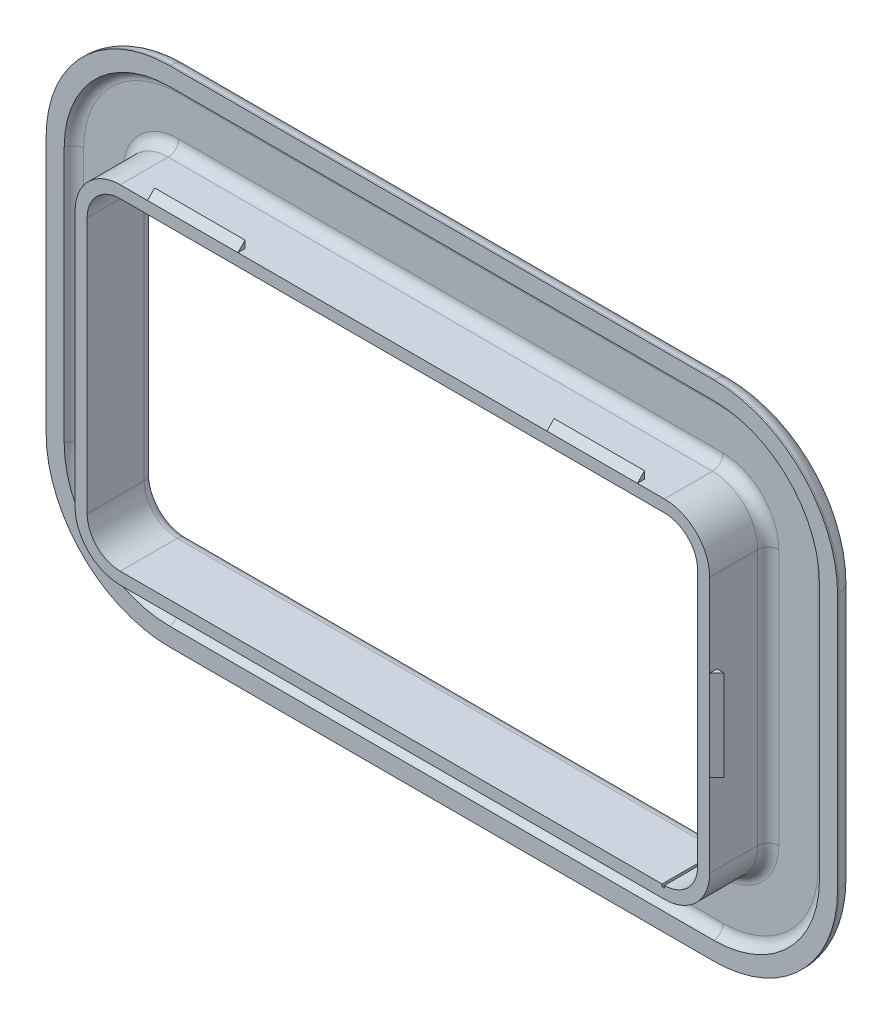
ISO-10303-21;
HEADER;
FILE_DESCRIPTION(('STEP AP214'),'2;1');
FILE_NAME('part.step','',(''),(''),'','','');
FILE_SCHEMA(('AUTOMOTIVE_DESIGN { 1 0 10303 214 1 1 1 1 }'));
ENDSEC;
DATA;
#1=APPLICATION_CONTEXT('core data for automotive mechanical design processes');
#2=APPLICATION_PROTOCOL_DEFINITION('international standard','automotive_design',2000,#1);
#3=PRODUCT_CONTEXT('',#1,'mechanical');
#4=PRODUCT('Part','Part','',(#3));
#5=PRODUCT_RELATED_PRODUCT_CATEGORY('part','',(#4));
#6=PRODUCT_DEFINITION_FORMATION('','',#4);
#7=PRODUCT_DEFINITION_CONTEXT('part definition',#1,'design');
#8=PRODUCT_DEFINITION('design','',#6,#7);
#9=PRODUCT_DEFINITION_SHAPE('','',#8);
#10=(LENGTH_UNIT() NAMED_UNIT(*) SI_UNIT(.MILLI.,.METRE.));
#11=(NAMED_UNIT(*) PLANE_ANGLE_UNIT() SI_UNIT($,.RADIAN.));
#12=(NAMED_UNIT(*) SI_UNIT($,.STERADIAN.) SOLID_ANGLE_UNIT());
#13=UNCERTAINTY_MEASURE_WITH_UNIT(LENGTH_MEASURE(1.E-05),#10,'distance_accuracy_value','');
#14=(GEOMETRIC_REPRESENTATION_CONTEXT(3) GLOBAL_UNCERTAINTY_ASSIGNED_CONTEXT((#13)) GLOBAL_UNIT_ASSIGNED_CONTEXT((#10,
#11,#12)) REPRESENTATION_CONTEXT('',''));
#15=CARTESIAN_POINT('',(0.,0.,0.));
#16=DIRECTION('',(0.,0.,1.));
#17=DIRECTION('',(1.,0.,0.));
#18=AXIS2_PLACEMENT_3D('',#15,#16,#17);
#19=CARTESIAN_POINT('',(-52.625,-7.5,11.2));
#20=DIRECTION('',(1.,0.,0.));
#21=DIRECTION('',(0.,0.,-1.));
#22=AXIS2_PLACEMENT_3D('',#19,#20,#21);
#23=PLANE('',#22);
#24=DIRECTION('',(0.,1.,0.));
#25=VECTOR('',#24,1.);
#26=CARTESIAN_POINT('',(-52.625,-7.5,10.));
#27=LINE('',#26,#25);
#28=CARTESIAN_POINT('',(-52.625,-7.5,10.));
#29=VERTEX_POINT('',#28);
#30=CARTESIAN_POINT('',(-52.625,7.5,10.));
#31=VERTEX_POINT('',#30);
#32=EDGE_CURVE('E100',#29,#31,#27,.T.);
#33=ORIENTED_EDGE('',*,*,#32,.T.);
#34=DIRECTION('',(0.,0.,-1.));
#35=VECTOR('',#34,1.);
#36=CARTESIAN_POINT('',(-52.625,7.5,11.2));
#37=LINE('',#36,#35);
#38=CARTESIAN_POINT('',(-52.625,7.5,11.2));
#39=VERTEX_POINT('',#38);
#40=EDGE_CURVE('E131',#39,#31,#37,.T.);
#41=ORIENTED_EDGE('',*,*,#40,.F.);
#42=DIRECTION('',(0.,1.,0.));
#43=VECTOR('',#42,1.);
#44=CARTESIAN_POINT('',(-52.625,-7.5,11.2));
#45=LINE('',#44,#43);
#46=CARTESIAN_POINT('',(-52.625,-7.5,11.2));
#47=VERTEX_POINT('',#46);
#48=EDGE_CURVE('E13',#47,#39,#45,.T.);
#49=ORIENTED_EDGE('',*,*,#48,.F.);
#50=DIRECTION('',(0.,0.,-1.));
#51=VECTOR('',#50,1.);
#52=CARTESIAN_POINT('',(-52.625,-7.5,11.2));
#53=LINE('',#52,#51);
#54=EDGE_CURVE('E132',#47,#29,#53,.T.);
#55=ORIENTED_EDGE('',*,*,#54,.T.);
#56=EDGE_LOOP('',(#33,#41,#49,#55));
#57=FACE_BOUND('',#56,.T.);
#58=ADVANCED_FACE('F97',(#57),#23,.T.);
#59=CARTESIAN_POINT('',(-53.825,-7.5,10.));
#60=DIRECTION('',(-0.707106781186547,0.,0.707106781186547));
#61=DIRECTION('',(0.707106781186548,0.,0.707106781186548));
#62=AXIS2_PLACEMENT_3D('',#59,#60,#61);
#63=PLANE('',#62);
#64=ORIENTED_EDGE('',*,*,#48,.T.);
#65=DIRECTION('',(0.707106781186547,0.,0.707106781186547));
#66=VECTOR('',#65,1.);
#67=CARTESIAN_POINT('',(-53.825,7.5,10.));
#68=LINE('',#67,#66);
#69=CARTESIAN_POINT('',(-53.825,7.5,10.));
#70=VERTEX_POINT('',#69);
#71=EDGE_CURVE('E141',#70,#39,#68,.T.);
#72=ORIENTED_EDGE('',*,*,#71,.F.);
#73=DIRECTION('',(0.,1.,0.));
#74=VECTOR('',#73,1.);
#75=CARTESIAN_POINT('',(-53.825,-7.5,10.));
#76=LINE('',#75,#74);
#77=CARTESIAN_POINT('',(-53.825,-7.5,10.));
#78=VERTEX_POINT('',#77);
#79=EDGE_CURVE('E105',#78,#70,#76,.T.);
#80=ORIENTED_EDGE('',*,*,#79,.F.);
#81=DIRECTION('',(0.707106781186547,0.,0.707106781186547));
#82=VECTOR('',#81,1.);
#83=CARTESIAN_POINT('',(-53.825,-7.5,10.));
#84=LINE('',#83,#82);
#85=EDGE_CURVE('E135',#78,#47,#84,.T.);
#86=ORIENTED_EDGE('',*,*,#85,.T.);
#87=EDGE_LOOP('',(#64,#72,#80,#86));
#88=FACE_BOUND('',#87,.T.);
#89=ADVANCED_FACE('F151',(#88),#63,.T.);
#90=CARTESIAN_POINT('',(-52.625,-7.5,10.));
#91=DIRECTION('',(0.,0.,-1.));
#92=DIRECTION('',(-1.,0.,0.));
#93=AXIS2_PLACEMENT_3D('',#90,#91,#92);
#94=PLANE('',#93);
#95=ORIENTED_EDGE('',*,*,#79,.T.);
#96=DIRECTION('',(-1.,0.,0.));
#97=VECTOR('',#96,1.);
#98=CARTESIAN_POINT('',(-52.625,7.5,10.));
#99=LINE('',#98,#97);
#100=EDGE_CURVE('E137',#31,#70,#99,.T.);
#101=ORIENTED_EDGE('',*,*,#100,.F.);
#102=ORIENTED_EDGE('',*,*,#32,.F.);
#103=DIRECTION('',(-1.,0.,0.));
#104=VECTOR('',#103,1.);
#105=CARTESIAN_POINT('',(-52.625,-7.5,10.));
#106=LINE('',#105,#104);
#107=EDGE_CURVE('E148',#29,#78,#106,.T.);
#108=ORIENTED_EDGE('',*,*,#107,.T.);
#109=EDGE_LOOP('',(#95,#101,#102,#108));
#110=FACE_BOUND('',#109,.T.);
#111=ADVANCED_FACE('F138',(#110),#94,.T.);
#112=CARTESIAN_POINT('',(0.,-7.5,0.));
#113=DIRECTION('',(0.,1.,0.));
#114=DIRECTION('',(0.,0.,1.));
#115=AXIS2_PLACEMENT_3D('',#112,#113,#114);
#116=PLANE('',#115);
#117=ORIENTED_EDGE('',*,*,#54,.F.);
#118=ORIENTED_EDGE('',*,*,#85,.F.);
#119=ORIENTED_EDGE('',*,*,#107,.F.);
#120=EDGE_LOOP('',(#117,#118,#119));
#121=FACE_BOUND('',#120,.T.);
#122=ADVANCED_FACE('F153',(#121),#116,.F.);
#123=CARTESIAN_POINT('',(0.,7.5,0.));
#124=DIRECTION('',(0.,1.,0.));
#125=DIRECTION('',(0.,0.,1.));
#126=AXIS2_PLACEMENT_3D('',#123,#124,#125);
#127=PLANE('',#126);
#128=ORIENTED_EDGE('',*,*,#40,.T.);
#129=ORIENTED_EDGE('',*,*,#100,.T.);
#130=ORIENTED_EDGE('',*,*,#71,.T.);
#131=EDGE_LOOP('',(#128,#129,#130));
#132=FACE_BOUND('',#131,.T.);
#133=ADVANCED_FACE('F143',(#132),#127,.T.);
#134=CLOSED_SHELL('',(#58,#89,#111,#122,#133));
#135=MANIFOLD_SOLID_BREP('B2',#134);
#136=CARTESIAN_POINT('',(-45.1249999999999,-28.75,11.2));
#137=DIRECTION('',(0.,1.,0.));
#138=DIRECTION('',(0.,0.,1.));
#139=AXIS2_PLACEMENT_3D('',#136,#137,#138);
#140=PLANE('',#139);
#141=DIRECTION('',(0.,0.,-1.));
#142=VECTOR('',#141,1.);
#143=CARTESIAN_POINT('',(25.625,-28.75,11.2));
#144=LINE('',#143,#142);
#145=CARTESIAN_POINT('',(25.625,-28.75,11.2));
#146=VERTEX_POINT('',#145);
#147=CARTESIAN_POINT('',(25.625,-28.75,10.));
#148=VERTEX_POINT('',#147);
#149=EDGE_CURVE('E1163',#146,#148,#144,.T.);
#150=ORIENTED_EDGE('',*,*,#149,.F.);
#151=DIRECTION('',(1.,0.,0.));
#152=VECTOR('',#151,1.);
#153=CARTESIAN_POINT('',(-45.1249999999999,-28.75,11.2));
#154=LINE('',#153,#152);
#155=CARTESIAN_POINT('',(-25.625,-28.75,11.2));
#156=VERTEX_POINT('',#155);
#157=EDGE_CURVE('E663',#156,#146,#154,.T.);
#158=ORIENTED_EDGE('',*,*,#157,.F.);
#159=DIRECTION('',(0.,0.,-1.));
#160=VECTOR('',#159,1.);
#161=CARTESIAN_POINT('',(-25.625,-28.75,11.2));
#162=LINE('',#161,#160);
#163=CARTESIAN_POINT('',(-25.625,-28.75,10.));
#164=VERTEX_POINT('',#163);
#165=EDGE_CURVE('E1194',#156,#164,#162,.T.);
#166=ORIENTED_EDGE('',*,*,#165,.T.);
#167=DIRECTION('',(-1.,0.,0.));
#168=VECTOR('',#167,1.);
#169=CARTESIAN_POINT('',(-25.625,-28.75,10.));
#170=LINE('',#169,#168);
#171=CARTESIAN_POINT('',(-40.625,-28.75,10.));
#172=VERTEX_POINT('',#171);
#173=EDGE_CURVE('E1210',#164,#172,#170,.T.);
#174=ORIENTED_EDGE('',*,*,#173,.T.);
#175=DIRECTION('',(0.,0.,-1.));
#176=VECTOR('',#175,1.);
#177=CARTESIAN_POINT('',(-40.625,-28.75,11.2));
#178=LINE('',#177,#176);
#179=CARTESIAN_POINT('',(-40.625,-28.75,11.2));
#180=VERTEX_POINT('',#179);
#181=EDGE_CURVE('E1205',#180,#172,#178,.T.);
#182=ORIENTED_EDGE('',*,*,#181,.F.);
#183=CARTESIAN_POINT('',(-45.1249999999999,-28.75,11.2));
#184=VERTEX_POINT('',#183);
#185=EDGE_CURVE('E659',#184,#180,#154,.T.);
#186=ORIENTED_EDGE('',*,*,#185,.F.);
#187=DIRECTION('',(0.,0.,-1.));
#188=VECTOR('',#187,1.);
#189=CARTESIAN_POINT('',(-45.1249999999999,-28.75,11.2));
#190=LINE('',#189,#188);
#191=CARTESIAN_POINT('',(-45.1249999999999,-28.75,3.25));
#192=VERTEX_POINT('',#191);
#193=EDGE_CURVE('E678',#184,#192,#190,.T.);
#194=ORIENTED_EDGE('',*,*,#193,.T.);
#195=DIRECTION('',(1.,0.,0.));
#196=VECTOR('',#195,1.);
#197=CARTESIAN_POINT('',(-45.1249999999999,-28.75,3.25));
#198=LINE('',#197,#196);
#199=CARTESIAN_POINT('',(45.125,-28.75,3.25));
#200=VERTEX_POINT('',#199);
#201=EDGE_CURVE('E829',#192,#200,#198,.T.);
#202=ORIENTED_EDGE('',*,*,#201,.T.);
#203=DIRECTION('',(0.,0.,-1.));
#204=VECTOR('',#203,1.);
#205=CARTESIAN_POINT('',(45.125,-28.75,11.2));
#206=LINE('',#205,#204);
#207=CARTESIAN_POINT('',(45.125,-28.75,11.2));
#208=VERTEX_POINT('',#207);
#209=EDGE_CURVE('E675',#208,#200,#206,.T.);
#210=ORIENTED_EDGE('',*,*,#209,.F.);
#211=CARTESIAN_POINT('',(40.625,-28.75,11.2));
#212=VERTEX_POINT('',#211);
#213=EDGE_CURVE('E658',#212,#208,#154,.T.);
#214=ORIENTED_EDGE('',*,*,#213,.F.);
#215=DIRECTION('',(0.,0.,-1.));
#216=VECTOR('',#215,1.);
#217=CARTESIAN_POINT('',(40.625,-28.75,11.2));
#218=LINE('',#217,#216);
#219=CARTESIAN_POINT('',(40.625,-28.75,10.));
#220=VERTEX_POINT('',#219);
#221=EDGE_CURVE('E218',#212,#220,#218,.T.);
#222=ORIENTED_EDGE('',*,*,#221,.T.);
#223=DIRECTION('',(1.,0.,0.));
#224=VECTOR('',#223,1.);
#225=CARTESIAN_POINT('',(25.625,-28.75,10.));
#226=LINE('',#225,#224);
#227=EDGE_CURVE('E1153',#148,#220,#226,.T.);
#228=ORIENTED_EDGE('',*,*,#227,.F.);
#229=EDGE_LOOP('',(#150,#158,#166,#174,#182,#186,#194,#202,#210,#214,#222,#228));
#230=FACE_BOUND('',#229,.T.);
#231=ADVANCED_FACE('F195',(#230),#140,.F.);
#232=CARTESIAN_POINT('',(52.625,21.25,11.2));
#233=DIRECTION('',(-1.,0.,0.));
#234=DIRECTION('',(0.,-1.,0.));
#235=AXIS2_PLACEMENT_3D('',#232,#233,#234);
#236=PLANE('',#235);
#237=DIRECTION('',(0.,0.,-1.));
#238=VECTOR('',#237,1.);
#239=CARTESIAN_POINT('',(52.625,-7.5,11.2));
#240=LINE('',#239,#238);
#241=CARTESIAN_POINT('',(52.625,-7.5,11.2));
#242=VERTEX_POINT('',#241);
#243=CARTESIAN_POINT('',(52.625,-7.5,10.));
#244=VERTEX_POINT('',#243);
#245=EDGE_CURVE('E1178',#242,#244,#240,.T.);
#246=ORIENTED_EDGE('',*,*,#245,.F.);
#247=DIRECTION('',(0.,1.,0.));
#248=VECTOR('',#247,1.);
#249=CARTESIAN_POINT('',(52.625,21.25,11.2));
#250=LINE('',#249,#248);
#251=CARTESIAN_POINT('',(52.625,-21.25,11.2));
#252=VERTEX_POINT('',#251);
#253=EDGE_CURVE('E666',#252,#242,#250,.T.);
#254=ORIENTED_EDGE('',*,*,#253,.F.);
#255=DIRECTION('',(0.,0.,-1.));
#256=VECTOR('',#255,1.);
#257=CARTESIAN_POINT('',(52.625,-21.25,11.2));
#258=LINE('',#257,#256);
#259=CARTESIAN_POINT('',(52.625,-21.25,3.25));
#260=VERTEX_POINT('',#259);
#261=EDGE_CURVE('E672',#252,#260,#258,.T.);
#262=ORIENTED_EDGE('',*,*,#261,.T.);
#263=DIRECTION('',(0.,1.,0.));
#264=VECTOR('',#263,1.);
#265=CARTESIAN_POINT('',(52.625,21.25,3.25));
#266=LINE('',#265,#264);
#267=CARTESIAN_POINT('',(52.625,21.25,3.25));
#268=VERTEX_POINT('',#267);
#269=EDGE_CURVE('E825',#260,#268,#266,.T.);
#270=ORIENTED_EDGE('',*,*,#269,.T.);
#271=DIRECTION('',(0.,0.,-1.));
#272=VECTOR('',#271,1.);
#273=CARTESIAN_POINT('',(52.625,21.25,11.2));
#274=LINE('',#273,#272);
#275=CARTESIAN_POINT('',(52.625,21.25,11.2));
#276=VERTEX_POINT('',#275);
#277=EDGE_CURVE('E669',#276,#268,#274,.T.);
#278=ORIENTED_EDGE('',*,*,#277,.F.);
#279=CARTESIAN_POINT('',(52.625,7.5,11.2));
#280=VERTEX_POINT('',#279);
#281=EDGE_CURVE('E665',#280,#276,#250,.T.);
#282=ORIENTED_EDGE('',*,*,#281,.F.);
#283=DIRECTION('',(0.,0.,-1.));
#284=VECTOR('',#283,1.);
#285=CARTESIAN_POINT('',(52.625,7.5,11.2));
#286=LINE('',#285,#284);
#287=CARTESIAN_POINT('',(52.625,7.5,10.));
#288=VERTEX_POINT('',#287);
#289=EDGE_CURVE('E1172',#280,#288,#286,.T.);
#290=ORIENTED_EDGE('',*,*,#289,.T.);
#291=DIRECTION('',(0.,1.,0.));
#292=VECTOR('',#291,1.);
#293=CARTESIAN_POINT('',(52.625,-7.5,10.));
#294=LINE('',#293,#292);
#295=EDGE_CURVE('E1169',#244,#288,#294,.T.);
#296=ORIENTED_EDGE('',*,*,#295,.F.);
#297=EDGE_LOOP('',(#246,#254,#262,#270,#278,#282,#290,#296));
#298=FACE_BOUND('',#297,.T.);
#299=ADVANCED_FACE('F1234',(#298),#236,.F.);
#300=CARTESIAN_POINT('',(45.125,21.25,11.2));
#301=DIRECTION('',(0.,0.,-1.));
#302=DIRECTION('',(-1.,0.,0.));
#303=AXIS2_PLACEMENT_3D('',#300,#301,#302);
#304=CYLINDRICAL_SURFACE('',#303,7.5);
#305=ORIENTED_EDGE('',*,*,#277,.T.);
#306=CARTESIAN_POINT('',(45.125,21.25,3.25));
#307=DIRECTION('',(0.,0.,1.));
#308=DIRECTION('',(1.,0.,0.));
#309=AXIS2_PLACEMENT_3D('',#306,#307,#308);
#310=CIRCLE('',#309,7.5);
#311=CARTESIAN_POINT('',(45.125,28.75,3.25));
#312=VERTEX_POINT('',#311);
#313=EDGE_CURVE('E823',#268,#312,#310,.T.);
#314=ORIENTED_EDGE('',*,*,#313,.T.);
#315=DIRECTION('',(0.,0.,-1.));
#316=VECTOR('',#315,1.);
#317=CARTESIAN_POINT('',(45.125,28.75,11.2));
#318=LINE('',#317,#316);
#319=CARTESIAN_POINT('',(45.125,28.75,11.2));
#320=VERTEX_POINT('',#319);
#321=EDGE_CURVE('E690',#320,#312,#318,.T.);
#322=ORIENTED_EDGE('',*,*,#321,.F.);
#323=CARTESIAN_POINT('',(45.125,21.25,11.2));
#324=DIRECTION('',(0.,0.,1.));
#325=DIRECTION('',(-1.,0.,0.));
#326=AXIS2_PLACEMENT_3D('',#323,#324,#325);
#327=CIRCLE('',#326,7.5);
#328=EDGE_CURVE('E644',#276,#320,#327,.T.);
#329=ORIENTED_EDGE('',*,*,#328,.F.);
#330=EDGE_LOOP('',(#305,#314,#322,#329));
#331=FACE_BOUND('',#330,.T.);
#332=ADVANCED_FACE('F1241',(#331),#304,.T.);
#333=CARTESIAN_POINT('',(-45.1249999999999,28.75,11.2));
#334=DIRECTION('',(0.,-1.,0.));
#335=DIRECTION('',(0.,0.,-1.));
#336=AXIS2_PLACEMENT_3D('',#333,#334,#335);
#337=PLANE('',#336);
#338=DIRECTION('',(-1.,0.,0.));
#339=VECTOR('',#338,1.);
#340=CARTESIAN_POINT('',(-45.1249999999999,28.75,11.2));
#341=LINE('',#340,#339);
#342=CARTESIAN_POINT('',(25.625,28.75,11.2));
#343=VERTEX_POINT('',#342);
#344=CARTESIAN_POINT('',(-25.625,28.75,11.2));
#345=VERTEX_POINT('',#344);
#346=EDGE_CURVE('E652',#343,#345,#341,.T.);
#347=ORIENTED_EDGE('',*,*,#346,.F.);
#348=DIRECTION('',(0.,0.,1.));
#349=VECTOR('',#348,1.);
#350=CARTESIAN_POINT('',(25.625,28.75,11.2));
#351=LINE('',#350,#349);
#352=CARTESIAN_POINT('',(25.625,28.75,9.99999999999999));
#353=VERTEX_POINT('',#352);
#354=EDGE_CURVE('E210',#353,#343,#351,.T.);
#355=ORIENTED_EDGE('',*,*,#354,.F.);
#356=DIRECTION('',(1.,0.,0.));
#357=VECTOR('',#356,1.);
#358=CARTESIAN_POINT('',(25.625,28.75,9.99999999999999));
#359=LINE('',#358,#357);
#360=CARTESIAN_POINT('',(40.625,28.75,9.99999999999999));
#361=VERTEX_POINT('',#360);
#362=EDGE_CURVE('E1141',#353,#361,#359,.T.);
#363=ORIENTED_EDGE('',*,*,#362,.T.);
#364=DIRECTION('',(0.,0.,1.));
#365=VECTOR('',#364,1.);
#366=CARTESIAN_POINT('',(40.625,28.75,11.2));
#367=LINE('',#366,#365);
#368=CARTESIAN_POINT('',(40.625,28.75,11.2));
#369=VERTEX_POINT('',#368);
#370=EDGE_CURVE('E1125',#361,#369,#367,.T.);
#371=ORIENTED_EDGE('',*,*,#370,.T.);
#372=EDGE_CURVE('E648',#320,#369,#341,.T.);
#373=ORIENTED_EDGE('',*,*,#372,.F.);
#374=ORIENTED_EDGE('',*,*,#321,.T.);
#375=DIRECTION('',(-1.,0.,0.));
#376=VECTOR('',#375,1.);
#377=CARTESIAN_POINT('',(-45.1249999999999,28.75,3.25));
#378=LINE('',#377,#376);
#379=CARTESIAN_POINT('',(-45.1249999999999,28.75,3.25));
#380=VERTEX_POINT('',#379);
#381=EDGE_CURVE('E821',#312,#380,#378,.T.);
#382=ORIENTED_EDGE('',*,*,#381,.T.);
#383=DIRECTION('',(0.,0.,-1.));
#384=VECTOR('',#383,1.);
#385=CARTESIAN_POINT('',(-45.1249999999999,28.75,11.2));
#386=LINE('',#385,#384);
#387=CARTESIAN_POINT('',(-45.1249999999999,28.75,11.2));
#388=VERTEX_POINT('',#387);
#389=EDGE_CURVE('E687',#388,#380,#386,.T.);
#390=ORIENTED_EDGE('',*,*,#389,.F.);
#391=CARTESIAN_POINT('',(-40.625,28.75,11.2));
#392=VERTEX_POINT('',#391);
#393=EDGE_CURVE('E647',#392,#388,#341,.T.);
#394=ORIENTED_EDGE('',*,*,#393,.F.);
#395=DIRECTION('',(0.,0.,1.));
#396=VECTOR('',#395,1.);
#397=CARTESIAN_POINT('',(-40.625,28.75,11.2));
#398=LINE('',#397,#396);
#399=CARTESIAN_POINT('',(-40.625,28.75,9.99999999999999));
#400=VERTEX_POINT('',#399);
#401=EDGE_CURVE('E964',#400,#392,#398,.T.);
#402=ORIENTED_EDGE('',*,*,#401,.F.);
#403=DIRECTION('',(-1.,0.,0.));
#404=VECTOR('',#403,1.);
#405=CARTESIAN_POINT('',(-25.625,28.75,9.99999999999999));
#406=LINE('',#405,#404);
#407=CARTESIAN_POINT('',(-25.625,28.75,9.99999999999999));
#408=VERTEX_POINT('',#407);
#409=EDGE_CURVE('E954',#408,#400,#406,.T.);
#410=ORIENTED_EDGE('',*,*,#409,.F.);
#411=DIRECTION('',(0.,0.,1.));
#412=VECTOR('',#411,1.);
#413=CARTESIAN_POINT('',(-25.625,28.75,11.2));
#414=LINE('',#413,#412);
#415=EDGE_CURVE('E961',#408,#345,#414,.T.);
#416=ORIENTED_EDGE('',*,*,#415,.T.);
#417=EDGE_LOOP('',(#347,#355,#363,#371,#373,#374,#382,#390,#394,#402,#410,#416));
#418=FACE_BOUND('',#417,.T.);
#419=ADVANCED_FACE('F929',(#418),#337,.F.);
#420=CARTESIAN_POINT('',(-45.125,21.25,11.2));
#421=DIRECTION('',(0.,0.,-1.));
#422=DIRECTION('',(-1.,0.,0.));
#423=AXIS2_PLACEMENT_3D('',#420,#421,#422);
#424=CYLINDRICAL_SURFACE('',#423,7.5);
#425=ORIENTED_EDGE('',*,*,#389,.T.);
#426=CARTESIAN_POINT('',(-45.125,21.25,3.25));
#427=DIRECTION('',(0.,0.,1.));
#428=DIRECTION('',(1.,0.,0.));
#429=AXIS2_PLACEMENT_3D('',#426,#427,#428);
#430=CIRCLE('',#429,7.5);
#431=CARTESIAN_POINT('',(-52.625,21.25,3.25));
#432=VERTEX_POINT('',#431);
#433=EDGE_CURVE('E818',#380,#432,#430,.T.);
#434=ORIENTED_EDGE('',*,*,#433,.T.);
#435=DIRECTION('',(0.,0.,-1.));
#436=VECTOR('',#435,1.);
#437=CARTESIAN_POINT('',(-52.625,21.25,11.2));
#438=LINE('',#437,#436);
#439=CARTESIAN_POINT('',(-52.625,21.25,11.2));
#440=VERTEX_POINT('',#439);
#441=EDGE_CURVE('E684',#440,#432,#438,.T.);
#442=ORIENTED_EDGE('',*,*,#441,.F.);
#443=CARTESIAN_POINT('',(-45.125,21.25,11.2));
#444=DIRECTION('',(0.,0.,1.));
#445=DIRECTION('',(1.,0.,0.));
#446=AXIS2_PLACEMENT_3D('',#443,#444,#445);
#447=CIRCLE('',#446,7.5);
#448=EDGE_CURVE('E651',#388,#440,#447,.T.);
#449=ORIENTED_EDGE('',*,*,#448,.F.);
#450=EDGE_LOOP('',(#425,#434,#442,#449));
#451=FACE_BOUND('',#450,.T.);
#452=ADVANCED_FACE('F934',(#451),#424,.T.);
#453=CARTESIAN_POINT('',(-52.625,21.25,11.2));
#454=DIRECTION('',(1.,0.,0.));
#455=DIRECTION('',(0.,1.,0.));
#456=AXIS2_PLACEMENT_3D('',#453,#454,#455);
#457=PLANE('',#456);
#458=ORIENTED_EDGE('',*,*,#441,.T.);
#459=DIRECTION('',(0.,-1.,0.));
#460=VECTOR('',#459,1.);
#461=CARTESIAN_POINT('',(-52.625,21.25,3.25));
#462=LINE('',#461,#460);
#463=CARTESIAN_POINT('',(-52.625,-21.2499999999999,3.25));
#464=VERTEX_POINT('',#463);
#465=EDGE_CURVE('E203',#432,#464,#462,.T.);
#466=ORIENTED_EDGE('',*,*,#465,.T.);
#467=DIRECTION('',(0.,0.,-1.));
#468=VECTOR('',#467,1.);
#469=CARTESIAN_POINT('',(-52.625,-21.2499999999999,11.2));
#470=LINE('',#469,#468);
#471=CARTESIAN_POINT('',(-52.625,-21.2499999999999,11.2));
#472=VERTEX_POINT('',#471);
#473=EDGE_CURVE('E681',#472,#464,#470,.T.);
#474=ORIENTED_EDGE('',*,*,#473,.F.);
#475=DIRECTION('',(0.,-1.,0.));
#476=VECTOR('',#475,1.);
#477=CARTESIAN_POINT('',(-52.625,21.25,11.2));
#478=LINE('',#477,#476);
#479=EDGE_CURVE('E654',#440,#472,#478,.T.);
#480=ORIENTED_EDGE('',*,*,#479,.F.);
#481=EDGE_LOOP('',(#458,#466,#474,#480));
#482=FACE_BOUND('',#481,.T.);
#483=ADVANCED_FACE('F1251',(#482),#457,.F.);
#484=CARTESIAN_POINT('',(-45.125,-21.25,11.2));
#485=DIRECTION('',(0.,0.,-1.));
#486=DIRECTION('',(-1.,0.,0.));
#487=AXIS2_PLACEMENT_3D('',#484,#485,#486);
#488=CYLINDRICAL_SURFACE('',#487,7.5);
#489=ORIENTED_EDGE('',*,*,#473,.T.);
#490=CARTESIAN_POINT('',(-45.125,-21.25,3.25));
#491=DIRECTION('',(0.,0.,1.));
#492=DIRECTION('',(1.,0.,0.));
#493=AXIS2_PLACEMENT_3D('',#490,#491,#492);
#494=CIRCLE('',#493,7.5);
#495=EDGE_CURVE('E831',#464,#192,#494,.T.);
#496=ORIENTED_EDGE('',*,*,#495,.T.);
#497=ORIENTED_EDGE('',*,*,#193,.F.);
#498=CARTESIAN_POINT('',(-45.125,-21.25,11.2));
#499=DIRECTION('',(0.,0.,1.));
#500=DIRECTION('',(1.,0.,0.));
#501=AXIS2_PLACEMENT_3D('',#498,#499,#500);
#502=CIRCLE('',#501,7.5);
#503=EDGE_CURVE('E656',#472,#184,#502,.T.);
#504=ORIENTED_EDGE('',*,*,#503,.F.);
#505=EDGE_LOOP('',(#489,#496,#497,#504));
#506=FACE_BOUND('',#505,.T.);
#507=ADVANCED_FACE('F1248',(#506),#488,.T.);
#508=CARTESIAN_POINT('',(45.125,-21.25,11.2));
#509=DIRECTION('',(0.,0.,-1.));
#510=DIRECTION('',(-1.,0.,0.));
#511=AXIS2_PLACEMENT_3D('',#508,#509,#510);
#512=CYLINDRICAL_SURFACE('',#511,7.5);
#513=ORIENTED_EDGE('',*,*,#209,.T.);
#514=CARTESIAN_POINT('',(45.125,-21.25,3.25));
#515=DIRECTION('',(0.,0.,1.));
#516=DIRECTION('',(1.,0.,0.));
#517=AXIS2_PLACEMENT_3D('',#514,#515,#516);
#518=CIRCLE('',#517,7.5);
#519=EDGE_CURVE('E827',#200,#260,#518,.T.);
#520=ORIENTED_EDGE('',*,*,#519,.T.);
#521=ORIENTED_EDGE('',*,*,#261,.F.);
#522=CARTESIAN_POINT('',(45.125,-21.25,11.2));
#523=DIRECTION('',(0.,0.,1.));
#524=DIRECTION('',(1.,0.,0.));
#525=AXIS2_PLACEMENT_3D('',#522,#523,#524);
#526=CIRCLE('',#525,7.5);
#527=EDGE_CURVE('E662',#208,#252,#526,.T.);
#528=ORIENTED_EDGE('',*,*,#527,.F.);
#529=EDGE_LOOP('',(#513,#520,#521,#528));
#530=FACE_BOUND('',#529,.T.);
#531=ADVANCED_FACE('F1247',(#530),#512,.T.);
#532=CARTESIAN_POINT('',(45.125,21.25,11.2));
#533=DIRECTION('',(0.,0.,1.));
#534=DIRECTION('',(1.,0.,0.));
#535=AXIS2_PLACEMENT_3D('',#532,#533,#534);
#536=PLANE('',#535);
#537=DIRECTION('',(0.,1.,0.));
#538=VECTOR('',#537,1.);
#539=CARTESIAN_POINT('',(45.125,-26.75,11.2));
#540=LINE('',#539,#538);
#541=CARTESIAN_POINT('',(45.125,-27.15,11.2));
#542=VERTEX_POINT('',#541);
#543=CARTESIAN_POINT('',(45.125,-26.75,11.2));
#544=VERTEX_POINT('',#543);
#545=EDGE_CURVE('E596',#542,#544,#540,.T.);
#546=ORIENTED_EDGE('',*,*,#545,.F.);
#547=DIRECTION('',(1.,0.,0.));
#548=VECTOR('',#547,1.);
#549=CARTESIAN_POINT('',(45.125,-27.15,11.2));
#550=LINE('',#549,#548);
#551=CARTESIAN_POINT('',(44.725,-27.15,11.2));
#552=VERTEX_POINT('',#551);
#553=EDGE_CURVE('E606',#552,#542,#550,.T.);
#554=ORIENTED_EDGE('',*,*,#553,.F.);
#555=DIRECTION('',(0.,-1.,0.));
#556=VECTOR('',#555,1.);
#557=CARTESIAN_POINT('',(44.725,-27.15,11.2));
#558=LINE('',#557,#556);
#559=CARTESIAN_POINT('',(44.725,-26.75,11.2));
#560=VERTEX_POINT('',#559);
#561=EDGE_CURVE('E589',#560,#552,#558,.T.);
#562=ORIENTED_EDGE('',*,*,#561,.F.);
#563=DIRECTION('',(1.,0.,0.));
#564=VECTOR('',#563,1.);
#565=CARTESIAN_POINT('',(45.125,-26.75,11.2));
#566=LINE('',#565,#564);
#567=CARTESIAN_POINT('',(-45.125,-26.75,11.2));
#568=VERTEX_POINT('',#567);
#569=EDGE_CURVE('E604',#568,#560,#566,.T.);
#570=ORIENTED_EDGE('',*,*,#569,.F.);
#571=CARTESIAN_POINT('',(-45.125,-21.25,11.2));
#572=DIRECTION('',(0.,0.,-1.));
#573=DIRECTION('',(-1.,0.,0.));
#574=AXIS2_PLACEMENT_3D('',#571,#572,#573);
#575=CIRCLE('',#574,5.5);
#576=CARTESIAN_POINT('',(-50.625,-21.2499999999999,11.2));
#577=VERTEX_POINT('',#576);
#578=EDGE_CURVE('E613',#577,#568,#575,.F.);
#579=ORIENTED_EDGE('',*,*,#578,.F.);
#580=DIRECTION('',(0.,-1.,0.));
#581=VECTOR('',#580,1.);
#582=CARTESIAN_POINT('',(-50.625,21.25,11.2));
#583=LINE('',#582,#581);
#584=CARTESIAN_POINT('',(-50.625,21.25,11.2));
#585=VERTEX_POINT('',#584);
#586=EDGE_CURVE('E618',#585,#577,#583,.T.);
#587=ORIENTED_EDGE('',*,*,#586,.F.);
#588=CARTESIAN_POINT('',(-45.125,21.25,11.2));
#589=DIRECTION('',(0.,0.,-1.));
#590=DIRECTION('',(-1.,0.,0.));
#591=AXIS2_PLACEMENT_3D('',#588,#589,#590);
#592=CIRCLE('',#591,5.5);
#593=CARTESIAN_POINT('',(-45.1249999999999,26.75,11.2));
#594=VERTEX_POINT('',#593);
#595=EDGE_CURVE('E1048',#594,#585,#592,.F.);
#596=ORIENTED_EDGE('',*,*,#595,.F.);
#597=DIRECTION('',(-1.,0.,0.));
#598=VECTOR('',#597,1.);
#599=CARTESIAN_POINT('',(45.125,26.75,11.2));
#600=LINE('',#599,#598);
#601=CARTESIAN_POINT('',(45.1249999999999,26.75,11.2));
#602=VERTEX_POINT('',#601);
#603=EDGE_CURVE('E1046',#602,#594,#600,.T.);
#604=ORIENTED_EDGE('',*,*,#603,.F.);
#605=CARTESIAN_POINT('',(45.125,21.25,11.2));
#606=DIRECTION('',(0.,0.,-1.));
#607=DIRECTION('',(-1.,0.,0.));
#608=AXIS2_PLACEMENT_3D('',#605,#606,#607);
#609=CIRCLE('',#608,5.5);
#610=CARTESIAN_POINT('',(50.625,21.25,11.2));
#611=VERTEX_POINT('',#610);
#612=EDGE_CURVE('E1024',#611,#602,#609,.F.);
#613=ORIENTED_EDGE('',*,*,#612,.F.);
#614=DIRECTION('',(0.,1.,0.));
#615=VECTOR('',#614,1.);
#616=CARTESIAN_POINT('',(50.625,21.25,11.2));
#617=LINE('',#616,#615);
#618=CARTESIAN_POINT('',(50.625,-21.25,11.2));
#619=VERTEX_POINT('',#618);
#620=EDGE_CURVE('E616',#619,#611,#617,.T.);
#621=ORIENTED_EDGE('',*,*,#620,.F.);
#622=CARTESIAN_POINT('',(45.125,-21.25,11.2));
#623=DIRECTION('',(0.,0.,-1.));
#624=DIRECTION('',(-1.,0.,0.));
#625=AXIS2_PLACEMENT_3D('',#622,#623,#624);
#626=CIRCLE('',#625,5.5);
#627=EDGE_CURVE('E612',#544,#619,#626,.F.);
#628=ORIENTED_EDGE('',*,*,#627,.F.);
#629=EDGE_LOOP('',(#546,#554,#562,#570,#579,#587,#596,#604,#613,#621,#628));
#630=FACE_BOUND('',#629,.T.);
#631=ORIENTED_EDGE('',*,*,#328,.T.);
#632=ORIENTED_EDGE('',*,*,#372,.T.);
#633=DIRECTION('',(1.,0.,0.));
#634=VECTOR('',#633,1.);
#635=CARTESIAN_POINT('',(25.625,28.75,11.2));
#636=LINE('',#635,#634);
#637=EDGE_CURVE('E944',#343,#369,#636,.T.);
#638=ORIENTED_EDGE('',*,*,#637,.F.);
#639=ORIENTED_EDGE('',*,*,#346,.T.);
#640=DIRECTION('',(-1.,0.,0.));
#641=VECTOR('',#640,1.);
#642=CARTESIAN_POINT('',(-25.625,28.75,11.2));
#643=LINE('',#642,#641);
#644=EDGE_CURVE('E940',#345,#392,#643,.T.);
#645=ORIENTED_EDGE('',*,*,#644,.T.);
#646=ORIENTED_EDGE('',*,*,#393,.T.);
#647=ORIENTED_EDGE('',*,*,#448,.T.);
#648=ORIENTED_EDGE('',*,*,#479,.T.);
#649=ORIENTED_EDGE('',*,*,#503,.T.);
#650=ORIENTED_EDGE('',*,*,#185,.T.);
#651=DIRECTION('',(-1.,0.,0.));
#652=VECTOR('',#651,1.);
#653=CARTESIAN_POINT('',(-25.625,-28.75,11.2));
#654=LINE('',#653,#652);
#655=EDGE_CURVE('E1201',#156,#180,#654,.T.);
#656=ORIENTED_EDGE('',*,*,#655,.F.);
#657=ORIENTED_EDGE('',*,*,#157,.T.);
#658=DIRECTION('',(1.,0.,0.));
#659=VECTOR('',#658,1.);
#660=CARTESIAN_POINT('',(25.625,-28.75,11.2));
#661=LINE('',#660,#659);
#662=EDGE_CURVE('E1166',#146,#212,#661,.T.);
#663=ORIENTED_EDGE('',*,*,#662,.T.);
#664=ORIENTED_EDGE('',*,*,#213,.T.);
#665=ORIENTED_EDGE('',*,*,#527,.T.);
#666=ORIENTED_EDGE('',*,*,#253,.T.);
#667=DIRECTION('',(0.,1.,0.));
#668=VECTOR('',#667,1.);
#669=CARTESIAN_POINT('',(52.625,-7.5,11.2));
#670=LINE('',#669,#668);
#671=EDGE_CURVE('E1175',#242,#280,#670,.T.);
#672=ORIENTED_EDGE('',*,*,#671,.T.);
#673=ORIENTED_EDGE('',*,*,#281,.T.);
#674=EDGE_LOOP('',(#631,#632,#638,#639,#645,#646,#647,#648,#649,#650,#656,#657,#663,#664,#665,
#666,#672,#673));
#675=FACE_BOUND('',#674,.T.);
#676=ADVANCED_FACE('F601',(#630,#675),#536,.T.);
#677=CARTESIAN_POINT('',(45.125,21.25,0.));
#678=DIRECTION('',(0.,0.,1.));
#679=DIRECTION('',(1.,0.,0.));
#680=AXIS2_PLACEMENT_3D('',#677,#678,#679);
#681=PLANE('',#680);
#682=DIRECTION('',(0.,1.,0.));
#683=VECTOR('',#682,1.);
#684=CARTESIAN_POINT('',(52.375,21.25,0.));
#685=LINE('',#684,#683);
#686=CARTESIAN_POINT('',(52.375,-21.25,0.));
#687=VERTEX_POINT('',#686);
#688=CARTESIAN_POINT('',(52.375,21.2499999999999,0.));
#689=VERTEX_POINT('',#688);
#690=EDGE_CURVE('E763',#687,#689,#685,.T.);
#691=ORIENTED_EDGE('',*,*,#690,.T.);
#692=CARTESIAN_POINT('',(45.125,21.25,0.));
#693=DIRECTION('',(0.,0.,1.));
#694=DIRECTION('',(1.,0.,0.));
#695=AXIS2_PLACEMENT_3D('',#692,#693,#694);
#696=CIRCLE('',#695,7.25);
#697=CARTESIAN_POINT('',(45.1249999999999,28.5,0.));
#698=VERTEX_POINT('',#697);
#699=EDGE_CURVE('E765',#689,#698,#696,.T.);
#700=ORIENTED_EDGE('',*,*,#699,.T.);
#701=DIRECTION('',(-1.,0.,0.));
#702=VECTOR('',#701,1.);
#703=CARTESIAN_POINT('',(-45.1249999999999,28.5,0.));
#704=LINE('',#703,#702);
#705=CARTESIAN_POINT('',(-45.1249999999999,28.5,0.));
#706=VERTEX_POINT('',#705);
#707=EDGE_CURVE('E727',#698,#706,#704,.T.);
#708=ORIENTED_EDGE('',*,*,#707,.T.);
#709=CARTESIAN_POINT('',(-45.125,21.25,0.));
#710=DIRECTION('',(0.,0.,1.));
#711=DIRECTION('',(1.,0.,0.));
#712=AXIS2_PLACEMENT_3D('',#709,#710,#711);
#713=CIRCLE('',#712,7.25);
#714=CARTESIAN_POINT('',(-52.375,21.25,0.));
#715=VERTEX_POINT('',#714);
#716=EDGE_CURVE('E753',#706,#715,#713,.T.);
#717=ORIENTED_EDGE('',*,*,#716,.T.);
#718=DIRECTION('',(0.,-1.,0.));
#719=VECTOR('',#718,1.);
#720=CARTESIAN_POINT('',(-52.375,-21.2499999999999,0.));
#721=LINE('',#720,#719);
#722=CARTESIAN_POINT('',(-52.375,-21.2499999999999,0.));
#723=VERTEX_POINT('',#722);
#724=EDGE_CURVE('E755',#715,#723,#721,.T.);
#725=ORIENTED_EDGE('',*,*,#724,.T.);
#726=CARTESIAN_POINT('',(-45.125,-21.25,0.));
#727=DIRECTION('',(0.,0.,1.));
#728=DIRECTION('',(1.,0.,0.));
#729=AXIS2_PLACEMENT_3D('',#726,#727,#728);
#730=CIRCLE('',#729,7.25);
#731=CARTESIAN_POINT('',(-45.125,-28.5,0.));
#732=VERTEX_POINT('',#731);
#733=EDGE_CURVE('E757',#723,#732,#730,.T.);
#734=ORIENTED_EDGE('',*,*,#733,.T.);
#735=DIRECTION('',(1.,0.,0.));
#736=VECTOR('',#735,1.);
#737=CARTESIAN_POINT('',(45.125,-28.5,0.));
#738=LINE('',#737,#736);
#739=CARTESIAN_POINT('',(45.1249999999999,-28.5,0.));
#740=VERTEX_POINT('',#739);
#741=EDGE_CURVE('E759',#732,#740,#738,.T.);
#742=ORIENTED_EDGE('',*,*,#741,.T.);
#743=CARTESIAN_POINT('',(45.125,-21.25,0.));
#744=DIRECTION('',(0.,0.,1.));
#745=DIRECTION('',(1.,0.,0.));
#746=AXIS2_PLACEMENT_3D('',#743,#744,#745);
#747=CIRCLE('',#746,7.25);
#748=EDGE_CURVE('E761',#740,#687,#747,.T.);
#749=ORIENTED_EDGE('',*,*,#748,.T.);
#750=EDGE_LOOP('',(#691,#700,#708,#717,#725,#734,#742,#749));
#751=FACE_BOUND('',#750,.T.);
#752=DIRECTION('',(-1.,0.,0.));
#753=VECTOR('',#752,1.);
#754=CARTESIAN_POINT('',(-45.1249999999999,-39.,0.));
#755=LINE('',#754,#753);
#756=CARTESIAN_POINT('',(45.1249999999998,-39.,0.));
#757=VERTEX_POINT('',#756);
#758=CARTESIAN_POINT('',(-45.1249999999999,-39.,0.));
#759=VERTEX_POINT('',#758);
#760=EDGE_CURVE('E705',#757,#759,#755,.T.);
#761=ORIENTED_EDGE('',*,*,#760,.T.);
#762=CARTESIAN_POINT('',(-45.125,-21.25,0.));
#763=DIRECTION('',(0.,0.,1.));
#764=DIRECTION('',(1.,0.,0.));
#765=AXIS2_PLACEMENT_3D('',#762,#763,#764);
#766=CIRCLE('',#765,17.75);
#767=CARTESIAN_POINT('',(-62.875,-21.2499999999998,0.));
#768=VERTEX_POINT('',#767);
#769=EDGE_CURVE('E707',#759,#768,#766,.F.);
#770=ORIENTED_EDGE('',*,*,#769,.T.);
#771=DIRECTION('',(0.,1.,0.));
#772=VECTOR('',#771,1.);
#773=CARTESIAN_POINT('',(-62.875,21.25,0.));
#774=LINE('',#773,#772);
#775=CARTESIAN_POINT('',(-62.875,21.25,0.));
#776=VERTEX_POINT('',#775);
#777=EDGE_CURVE('E693',#768,#776,#774,.T.);
#778=ORIENTED_EDGE('',*,*,#777,.T.);
#779=CARTESIAN_POINT('',(-45.125,21.25,0.));
#780=DIRECTION('',(0.,0.,1.));
#781=DIRECTION('',(1.,0.,0.));
#782=AXIS2_PLACEMENT_3D('',#779,#780,#781);
#783=CIRCLE('',#782,17.75);
#784=CARTESIAN_POINT('',(-45.1249999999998,39.,0.));
#785=VERTEX_POINT('',#784);
#786=EDGE_CURVE('E695',#776,#785,#783,.F.);
#787=ORIENTED_EDGE('',*,*,#786,.T.);
#788=DIRECTION('',(1.,0.,0.));
#789=VECTOR('',#788,1.);
#790=CARTESIAN_POINT('',(45.1249999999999,39.,0.));
#791=LINE('',#790,#789);
#792=CARTESIAN_POINT('',(45.125,39.,0.));
#793=VERTEX_POINT('',#792);
#794=EDGE_CURVE('E697',#785,#793,#791,.T.);
#795=ORIENTED_EDGE('',*,*,#794,.T.);
#796=CARTESIAN_POINT('',(45.125,21.25,0.));
#797=DIRECTION('',(0.,0.,1.));
#798=DIRECTION('',(1.,0.,0.));
#799=AXIS2_PLACEMENT_3D('',#796,#797,#798);
#800=CIRCLE('',#799,17.75);
#801=CARTESIAN_POINT('',(62.875,21.2499999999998,0.));
#802=VERTEX_POINT('',#801);
#803=EDGE_CURVE('E699',#793,#802,#800,.F.);
#804=ORIENTED_EDGE('',*,*,#803,.T.);
#805=DIRECTION('',(0.,-1.,0.));
#806=VECTOR('',#805,1.);
#807=CARTESIAN_POINT('',(62.875,-21.25,0.));
#808=LINE('',#807,#806);
#809=CARTESIAN_POINT('',(62.875,-21.25,0.));
#810=VERTEX_POINT('',#809);
#811=EDGE_CURVE('E701',#802,#810,#808,.T.);
#812=ORIENTED_EDGE('',*,*,#811,.T.);
#813=CARTESIAN_POINT('',(45.125,-21.25,0.));
#814=DIRECTION('',(0.,0.,1.));
#815=DIRECTION('',(1.,0.,0.));
#816=AXIS2_PLACEMENT_3D('',#813,#814,#815);
#817=CIRCLE('',#816,17.75);
#818=EDGE_CURVE('E703',#810,#757,#817,.F.);
#819=ORIENTED_EDGE('',*,*,#818,.T.);
#820=EDGE_LOOP('',(#761,#770,#778,#787,#795,#804,#812,#819));
#821=FACE_BOUND('',#820,.T.);
#822=ADVANCED_FACE('F1071',(#751,#821),#681,.F.);
#823=CARTESIAN_POINT('',(45.125,21.25,11.2));
#824=DIRECTION('',(0.,0.,-1.));
#825=DIRECTION('',(-1.,0.,0.));
#826=AXIS2_PLACEMENT_3D('',#823,#824,#825);
#827=CYLINDRICAL_SURFACE('',#826,5.5);
#828=DIRECTION('',(0.,0.,-1.));
#829=VECTOR('',#828,1.);
#830=CARTESIAN_POINT('',(45.1249999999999,26.75,11.2));
#831=LINE('',#830,#829);
#832=CARTESIAN_POINT('',(45.1249999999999,26.75,1.75));
#833=VERTEX_POINT('',#832);
#834=EDGE_CURVE('E641',#602,#833,#831,.T.);
#835=ORIENTED_EDGE('',*,*,#834,.T.);
#836=CARTESIAN_POINT('',(45.125,21.25,1.75));
#837=DIRECTION('',(0.,0.,1.));
#838=DIRECTION('',(1.,0.,0.));
#839=AXIS2_PLACEMENT_3D('',#836,#837,#838);
#840=CIRCLE('',#839,5.5);
#841=CARTESIAN_POINT('',(50.625,21.25,1.75));
#842=VERTEX_POINT('',#841);
#843=EDGE_CURVE('E768',#833,#842,#840,.F.);
#844=ORIENTED_EDGE('',*,*,#843,.T.);
#845=DIRECTION('',(0.,0.,-1.));
#846=VECTOR('',#845,1.);
#847=CARTESIAN_POINT('',(50.625,21.25,11.2));
#848=LINE('',#847,#846);
#849=EDGE_CURVE('E623',#611,#842,#848,.T.);
#850=ORIENTED_EDGE('',*,*,#849,.F.);
#851=ORIENTED_EDGE('',*,*,#612,.T.);
#852=EDGE_LOOP('',(#835,#844,#850,#851));
#853=FACE_BOUND('',#852,.T.);
#854=ADVANCED_FACE('F1092',(#853),#827,.F.);
#855=CARTESIAN_POINT('',(45.125,26.75,11.2));
#856=DIRECTION('',(0.,-1.,0.));
#857=DIRECTION('',(0.,0.,-1.));
#858=AXIS2_PLACEMENT_3D('',#855,#856,#857);
#859=PLANE('',#858);
#860=DIRECTION('',(0.,0.,-1.));
#861=VECTOR('',#860,1.);
#862=CARTESIAN_POINT('',(-45.1249999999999,26.75,11.2));
#863=LINE('',#862,#861);
#864=CARTESIAN_POINT('',(-45.1249999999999,26.75,1.75));
#865=VERTEX_POINT('',#864);
#866=EDGE_CURVE('E638',#594,#865,#863,.T.);
#867=ORIENTED_EDGE('',*,*,#866,.T.);
#868=DIRECTION('',(-1.,0.,0.));
#869=VECTOR('',#868,1.);
#870=CARTESIAN_POINT('',(45.1249999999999,26.75,1.75));
#871=LINE('',#870,#869);
#872=EDGE_CURVE('E833',#865,#833,#871,.F.);
#873=ORIENTED_EDGE('',*,*,#872,.T.);
#874=ORIENTED_EDGE('',*,*,#834,.F.);
#875=ORIENTED_EDGE('',*,*,#603,.T.);
#876=EDGE_LOOP('',(#867,#873,#874,#875));
#877=FACE_BOUND('',#876,.T.);
#878=ADVANCED_FACE('F1087',(#877),#859,.T.);
#879=CARTESIAN_POINT('',(-45.125,21.25,11.2));
#880=DIRECTION('',(0.,0.,-1.));
#881=DIRECTION('',(-1.,0.,0.));
#882=AXIS2_PLACEMENT_3D('',#879,#880,#881);
#883=CYLINDRICAL_SURFACE('',#882,5.5);
#884=DIRECTION('',(0.,0.,-1.));
#885=VECTOR('',#884,1.);
#886=CARTESIAN_POINT('',(-50.625,21.25,11.2));
#887=LINE('',#886,#885);
#888=CARTESIAN_POINT('',(-50.625,21.25,1.75));
#889=VERTEX_POINT('',#888);
#890=EDGE_CURVE('E635',#585,#889,#887,.T.);
#891=ORIENTED_EDGE('',*,*,#890,.T.);
#892=CARTESIAN_POINT('',(-45.125,21.25,1.75));
#893=DIRECTION('',(0.,0.,1.));
#894=DIRECTION('',(1.,0.,0.));
#895=AXIS2_PLACEMENT_3D('',#892,#893,#894);
#896=CIRCLE('',#895,5.5);
#897=EDGE_CURVE('E782',#889,#865,#896,.F.);
#898=ORIENTED_EDGE('',*,*,#897,.T.);
#899=ORIENTED_EDGE('',*,*,#866,.F.);
#900=ORIENTED_EDGE('',*,*,#595,.T.);
#901=EDGE_LOOP('',(#891,#898,#899,#900));
#902=FACE_BOUND('',#901,.T.);
#903=ADVANCED_FACE('F1080',(#902),#883,.F.);
#904=CARTESIAN_POINT('',(-50.625,21.25,11.2));
#905=DIRECTION('',(1.,0.,0.));
#906=DIRECTION('',(0.,1.,0.));
#907=AXIS2_PLACEMENT_3D('',#904,#905,#906);
#908=PLANE('',#907);
#909=DIRECTION('',(0.,0.,-1.));
#910=VECTOR('',#909,1.);
#911=CARTESIAN_POINT('',(-50.625,-21.2499999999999,11.2));
#912=LINE('',#911,#910);
#913=CARTESIAN_POINT('',(-50.625,-21.2499999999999,1.75));
#914=VERTEX_POINT('',#913);
#915=EDGE_CURVE('E632',#577,#914,#912,.T.);
#916=ORIENTED_EDGE('',*,*,#915,.T.);
#917=DIRECTION('',(0.,-1.,0.));
#918=VECTOR('',#917,1.);
#919=CARTESIAN_POINT('',(-50.625,21.25,1.75));
#920=LINE('',#919,#918);
#921=EDGE_CURVE('E780',#914,#889,#920,.F.);
#922=ORIENTED_EDGE('',*,*,#921,.T.);
#923=ORIENTED_EDGE('',*,*,#890,.F.);
#924=ORIENTED_EDGE('',*,*,#586,.T.);
#925=EDGE_LOOP('',(#916,#922,#923,#924));
#926=FACE_BOUND('',#925,.T.);
#927=ADVANCED_FACE('F1053',(#926),#908,.T.);
#928=CARTESIAN_POINT('',(-45.125,-21.25,11.2));
#929=DIRECTION('',(0.,0.,-1.));
#930=DIRECTION('',(-1.,0.,0.));
#931=AXIS2_PLACEMENT_3D('',#928,#929,#930);
#932=CYLINDRICAL_SURFACE('',#931,5.5);
#933=DIRECTION('',(0.,0.,-1.));
#934=VECTOR('',#933,1.);
#935=CARTESIAN_POINT('',(-45.125,-26.75,11.2));
#936=LINE('',#935,#934);
#937=CARTESIAN_POINT('',(-45.125,-26.75,1.75));
#938=VERTEX_POINT('',#937);
#939=EDGE_CURVE('E611',#568,#938,#936,.T.);
#940=ORIENTED_EDGE('',*,*,#939,.T.);
#941=CARTESIAN_POINT('',(-45.125,-21.25,1.75));
#942=DIRECTION('',(0.,0.,1.));
#943=DIRECTION('',(1.,0.,0.));
#944=AXIS2_PLACEMENT_3D('',#941,#942,#943);
#945=CIRCLE('',#944,5.5);
#946=EDGE_CURVE('E778',#938,#914,#945,.F.);
#947=ORIENTED_EDGE('',*,*,#946,.T.);
#948=ORIENTED_EDGE('',*,*,#915,.F.);
#949=ORIENTED_EDGE('',*,*,#578,.T.);
#950=EDGE_LOOP('',(#940,#947,#948,#949));
#951=FACE_BOUND('',#950,.T.);
#952=ADVANCED_FACE('F1057',(#951),#932,.F.);
#953=CARTESIAN_POINT('',(45.125,-26.75,11.2));
#954=DIRECTION('',(0.,1.,0.));
#955=DIRECTION('',(0.,0.,1.));
#956=AXIS2_PLACEMENT_3D('',#953,#954,#955);
#957=PLANE('',#956);
#958=DIRECTION('',(0.,0.,1.));
#959=VECTOR('',#958,1.);
#960=CARTESIAN_POINT('',(44.725,-26.75,0.));
#961=LINE('',#960,#959);
#962=CARTESIAN_POINT('',(44.725,-26.75,1.75));
#963=VERTEX_POINT('',#962);
#964=EDGE_CURVE('E585',#963,#560,#961,.T.);
#965=ORIENTED_EDGE('',*,*,#964,.F.);
#966=DIRECTION('',(1.,0.,0.));
#967=VECTOR('',#966,1.);
#968=CARTESIAN_POINT('',(-45.1249999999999,-26.75,1.75));
#969=LINE('',#968,#967);
#970=EDGE_CURVE('E776',#963,#938,#969,.F.);
#971=ORIENTED_EDGE('',*,*,#970,.T.);
#972=ORIENTED_EDGE('',*,*,#939,.F.);
#973=ORIENTED_EDGE('',*,*,#569,.T.);
#974=EDGE_LOOP('',(#965,#971,#972,#973));
#975=FACE_BOUND('',#974,.T.);
#976=ADVANCED_FACE('F609',(#975),#957,.T.);
#977=CARTESIAN_POINT('',(45.125,-21.25,11.2));
#978=DIRECTION('',(0.,0.,-1.));
#979=DIRECTION('',(-1.,0.,0.));
#980=AXIS2_PLACEMENT_3D('',#977,#978,#979);
#981=CYLINDRICAL_SURFACE('',#980,5.5);
#982=DIRECTION('',(0.,0.,-1.));
#983=VECTOR('',#982,1.);
#984=CARTESIAN_POINT('',(50.625,-21.25,11.2));
#985=LINE('',#984,#983);
#986=CARTESIAN_POINT('',(50.625,-21.25,1.75));
#987=VERTEX_POINT('',#986);
#988=EDGE_CURVE('E626',#619,#987,#985,.T.);
#989=ORIENTED_EDGE('',*,*,#988,.T.);
#990=CARTESIAN_POINT('',(45.125,-21.25,1.75));
#991=DIRECTION('',(0.,0.,1.));
#992=DIRECTION('',(1.,0.,0.));
#993=AXIS2_PLACEMENT_3D('',#990,#991,#992);
#994=CIRCLE('',#993,5.5);
#995=CARTESIAN_POINT('',(45.125,-26.75,1.75));
#996=VERTEX_POINT('',#995);
#997=EDGE_CURVE('E773',#987,#996,#994,.F.);
#998=ORIENTED_EDGE('',*,*,#997,.T.);
#999=DIRECTION('',(0.,0.,-1.));
#1000=VECTOR('',#999,1.);
#1001=CARTESIAN_POINT('',(45.125,-26.75,11.2));
#1002=LINE('',#1001,#1000);
#1003=EDGE_CURVE('E629',#544,#996,#1002,.T.);
#1004=ORIENTED_EDGE('',*,*,#1003,.F.);
#1005=ORIENTED_EDGE('',*,*,#627,.T.);
#1006=EDGE_LOOP('',(#989,#998,#1004,#1005));
#1007=FACE_BOUND('',#1006,.T.);
#1008=ADVANCED_FACE('F1111',(#1007),#981,.F.);
#1009=CARTESIAN_POINT('',(50.625,21.25,11.2));
#1010=DIRECTION('',(-1.,0.,0.));
#1011=DIRECTION('',(0.,-1.,0.));
#1012=AXIS2_PLACEMENT_3D('',#1009,#1010,#1011);
#1013=PLANE('',#1012);
#1014=ORIENTED_EDGE('',*,*,#849,.T.);
#1015=DIRECTION('',(0.,1.,0.));
#1016=VECTOR('',#1015,1.);
#1017=CARTESIAN_POINT('',(50.625,-21.25,1.75));
#1018=LINE('',#1017,#1016);
#1019=EDGE_CURVE('E771',#842,#987,#1018,.F.);
#1020=ORIENTED_EDGE('',*,*,#1019,.T.);
#1021=ORIENTED_EDGE('',*,*,#988,.F.);
#1022=ORIENTED_EDGE('',*,*,#620,.T.);
#1023=EDGE_LOOP('',(#1014,#1020,#1021,#1022));
#1024=FACE_BOUND('',#1023,.T.);
#1025=ADVANCED_FACE('F1108',(#1024),#1013,.T.);
#1026=CARTESIAN_POINT('',(-45.125,-21.25,3.));
#1027=DIRECTION('',(0.,0.,-1.));
#1028=DIRECTION('',(-1.,0.,0.));
#1029=AXIS2_PLACEMENT_3D('',#1026,#1027,#1028);
#1030=PLANE('',#1029);
#1031=DIRECTION('',(1.,0.,0.));
#1032=VECTOR('',#1031,1.);
#1033=CARTESIAN_POINT('',(-45.1249999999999,-38.75,3.));
#1034=LINE('',#1033,#1032);
#1035=CARTESIAN_POINT('',(-45.1249999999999,-38.75,3.));
#1036=VERTEX_POINT('',#1035);
#1037=CARTESIAN_POINT('',(45.1249999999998,-38.75,3.));
#1038=VERTEX_POINT('',#1037);
#1039=EDGE_CURVE('E975',#1036,#1038,#1034,.T.);
#1040=ORIENTED_EDGE('',*,*,#1039,.F.);
#1041=CARTESIAN_POINT('',(-45.125,-21.25,3.));
#1042=DIRECTION('',(0.,0.,1.));
#1043=DIRECTION('',(1.,0.,0.));
#1044=AXIS2_PLACEMENT_3D('',#1041,#1042,#1043);
#1045=CIRCLE('',#1044,17.5);
#1046=CARTESIAN_POINT('',(-62.625,-21.2499999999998,3.));
#1047=VERTEX_POINT('',#1046);
#1048=EDGE_CURVE('E751',#1047,#1036,#1045,.T.);
#1049=ORIENTED_EDGE('',*,*,#1048,.F.);
#1050=DIRECTION('',(0.,-1.,0.));
#1051=VECTOR('',#1050,1.);
#1052=CARTESIAN_POINT('',(-62.625,21.25,3.));
#1053=LINE('',#1052,#1051);
#1054=CARTESIAN_POINT('',(-62.625,21.25,3.));
#1055=VERTEX_POINT('',#1054);
#1056=EDGE_CURVE('E993',#1055,#1047,#1053,.T.);
#1057=ORIENTED_EDGE('',*,*,#1056,.F.);
#1058=CARTESIAN_POINT('',(-45.125,21.25,3.));
#1059=DIRECTION('',(0.,0.,1.));
#1060=DIRECTION('',(1.,0.,0.));
#1061=AXIS2_PLACEMENT_3D('',#1058,#1059,#1060);
#1062=CIRCLE('',#1061,17.5);
#1063=CARTESIAN_POINT('',(-45.1249999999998,38.75,3.));
#1064=VERTEX_POINT('',#1063);
#1065=EDGE_CURVE('E990',#1064,#1055,#1062,.T.);
#1066=ORIENTED_EDGE('',*,*,#1065,.F.);
#1067=DIRECTION('',(-1.,0.,0.));
#1068=VECTOR('',#1067,1.);
#1069=CARTESIAN_POINT('',(45.125,38.75,3.));
#1070=LINE('',#1069,#1068);
#1071=CARTESIAN_POINT('',(45.125,38.75,3.));
#1072=VERTEX_POINT('',#1071);
#1073=EDGE_CURVE('E987',#1072,#1064,#1070,.T.);
#1074=ORIENTED_EDGE('',*,*,#1073,.F.);
#1075=CARTESIAN_POINT('',(45.125,21.25,3.));
#1076=DIRECTION('',(0.,0.,1.));
#1077=DIRECTION('',(1.,0.,0.));
#1078=AXIS2_PLACEMENT_3D('',#1075,#1076,#1077);
#1079=CIRCLE('',#1078,17.5);
#1080=CARTESIAN_POINT('',(62.625,21.2499999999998,3.));
#1081=VERTEX_POINT('',#1080);
#1082=EDGE_CURVE('E984',#1081,#1072,#1079,.T.);
#1083=ORIENTED_EDGE('',*,*,#1082,.F.);
#1084=DIRECTION('',(0.,1.,0.));
#1085=VECTOR('',#1084,1.);
#1086=CARTESIAN_POINT('',(62.625,-21.25,3.));
#1087=LINE('',#1086,#1085);
#1088=CARTESIAN_POINT('',(62.625,-21.25,3.));
#1089=VERTEX_POINT('',#1088);
#1090=EDGE_CURVE('E981',#1089,#1081,#1087,.T.);
#1091=ORIENTED_EDGE('',*,*,#1090,.F.);
#1092=CARTESIAN_POINT('',(45.125,-21.25,3.));
#1093=DIRECTION('',(0.,0.,1.));
#1094=DIRECTION('',(1.,0.,0.));
#1095=AXIS2_PLACEMENT_3D('',#1092,#1093,#1094);
#1096=CIRCLE('',#1095,17.5);
#1097=EDGE_CURVE('E978',#1038,#1089,#1096,.T.);
#1098=ORIENTED_EDGE('',*,*,#1097,.F.);
#1099=EDGE_LOOP('',(#1040,#1049,#1057,#1066,#1074,#1083,#1091,#1098));
#1100=FACE_BOUND('',#1099,.T.);
#1101=CARTESIAN_POINT('',(-45.125,-21.25,3.));
#1102=DIRECTION('',(0.,0.,-1.));
#1103=DIRECTION('',(-1.,0.,0.));
#1104=AXIS2_PLACEMENT_3D('',#1101,#1102,#1103);
#1105=CIRCLE('',#1104,20.5);
#1106=CARTESIAN_POINT('',(-45.1249999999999,-41.75,3.));
#1107=VERTEX_POINT('',#1106);
#1108=CARTESIAN_POINT('',(-65.625,-21.2499999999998,3.));
#1109=VERTEX_POINT('',#1108);
#1110=EDGE_CURVE('E996',#1107,#1109,#1105,.T.);
#1111=ORIENTED_EDGE('',*,*,#1110,.F.);
#1112=DIRECTION('',(-1.,0.,0.));
#1113=VECTOR('',#1112,1.);
#1114=CARTESIAN_POINT('',(-45.1249999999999,-41.75,3.));
#1115=LINE('',#1114,#1113);
#1116=CARTESIAN_POINT('',(45.1249999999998,-41.75,3.));
#1117=VERTEX_POINT('',#1116);
#1118=EDGE_CURVE('E1017',#1117,#1107,#1115,.T.);
#1119=ORIENTED_EDGE('',*,*,#1118,.F.);
#1120=CARTESIAN_POINT('',(45.125,-21.25,3.));
#1121=DIRECTION('',(0.,0.,-1.));
#1122=DIRECTION('',(-1.,0.,0.));
#1123=AXIS2_PLACEMENT_3D('',#1120,#1121,#1122);
#1124=CIRCLE('',#1123,20.5);
#1125=CARTESIAN_POINT('',(65.625,-21.25,3.));
#1126=VERTEX_POINT('',#1125);
#1127=EDGE_CURVE('E1014',#1126,#1117,#1124,.T.);
#1128=ORIENTED_EDGE('',*,*,#1127,.F.);
#1129=DIRECTION('',(0.,-1.,0.));
#1130=VECTOR('',#1129,1.);
#1131=CARTESIAN_POINT('',(65.625,-21.25,3.));
#1132=LINE('',#1131,#1130);
#1133=CARTESIAN_POINT('',(65.625,21.2499999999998,3.));
#1134=VERTEX_POINT('',#1133);
#1135=EDGE_CURVE('E1011',#1134,#1126,#1132,.T.);
#1136=ORIENTED_EDGE('',*,*,#1135,.F.);
#1137=CARTESIAN_POINT('',(45.125,21.25,3.));
#1138=DIRECTION('',(0.,0.,-1.));
#1139=DIRECTION('',(-1.,0.,0.));
#1140=AXIS2_PLACEMENT_3D('',#1137,#1138,#1139);
#1141=CIRCLE('',#1140,20.5);
#1142=CARTESIAN_POINT('',(45.1249999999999,41.75,3.));
#1143=VERTEX_POINT('',#1142);
#1144=EDGE_CURVE('E1008',#1143,#1134,#1141,.T.);
#1145=ORIENTED_EDGE('',*,*,#1144,.F.);
#1146=DIRECTION('',(1.,0.,0.));
#1147=VECTOR('',#1146,1.);
#1148=CARTESIAN_POINT('',(45.1249999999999,41.75,3.));
#1149=LINE('',#1148,#1147);
#1150=CARTESIAN_POINT('',(-45.1249999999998,41.75,3.));
#1151=VERTEX_POINT('',#1150);
#1152=EDGE_CURVE('E1005',#1151,#1143,#1149,.T.);
#1153=ORIENTED_EDGE('',*,*,#1152,.F.);
#1154=CARTESIAN_POINT('',(-45.125,21.25,3.));
#1155=DIRECTION('',(0.,0.,-1.));
#1156=DIRECTION('',(-1.,0.,0.));
#1157=AXIS2_PLACEMENT_3D('',#1154,#1155,#1156);
#1158=CIRCLE('',#1157,20.5);
#1159=CARTESIAN_POINT('',(-65.625,21.25,3.));
#1160=VERTEX_POINT('',#1159);
#1161=EDGE_CURVE('E1002',#1160,#1151,#1158,.T.);
#1162=ORIENTED_EDGE('',*,*,#1161,.F.);
#1163=DIRECTION('',(0.,1.,0.));
#1164=VECTOR('',#1163,1.);
#1165=CARTESIAN_POINT('',(-65.625,21.25,3.));
#1166=LINE('',#1165,#1164);
#1167=EDGE_CURVE('E999',#1109,#1160,#1166,.T.);
#1168=ORIENTED_EDGE('',*,*,#1167,.F.);
#1169=EDGE_LOOP('',(#1111,#1119,#1128,#1136,#1145,#1153,#1162,#1168));
#1170=FACE_BOUND('',#1169,.T.);
#1171=ADVANCED_FACE('F1458',(#1100,#1170),#1030,.F.);
#1172=CARTESIAN_POINT('',(-45.125,-21.25,3.));
#1173=DIRECTION('',(0.,0.,-1.));
#1174=DIRECTION('',(-1.,0.,0.));
#1175=AXIS2_PLACEMENT_3D('',#1172,#1173,#1174);
#1176=CYLINDRICAL_SURFACE('',#1175,20.5);
#1177=DIRECTION('',(0.,0.,-1.));
#1178=VECTOR('',#1177,1.);
#1179=CARTESIAN_POINT('',(-65.625,-21.2499999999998,3.));
#1180=LINE('',#1179,#1178);
#1181=CARTESIAN_POINT('',(-65.625,-21.2499999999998,2.75));
#1182=VERTEX_POINT('',#1181);
#1183=EDGE_CURVE('E1020',#1109,#1182,#1180,.T.);
#1184=ORIENTED_EDGE('',*,*,#1183,.T.);
#1185=CARTESIAN_POINT('',(-45.125,-21.25,2.75));
#1186=DIRECTION('',(0.,0.,1.));
#1187=DIRECTION('',(1.,0.,0.));
#1188=AXIS2_PLACEMENT_3D('',#1185,#1186,#1187);
#1189=CIRCLE('',#1188,20.5);
#1190=CARTESIAN_POINT('',(-45.1249999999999,-41.75,2.75));
#1191=VERTEX_POINT('',#1190);
#1192=EDGE_CURVE('E710',#1182,#1191,#1189,.T.);
#1193=ORIENTED_EDGE('',*,*,#1192,.T.);
#1194=DIRECTION('',(0.,0.,-1.));
#1195=VECTOR('',#1194,1.);
#1196=CARTESIAN_POINT('',(-45.1249999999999,-41.75,3.));
#1197=LINE('',#1196,#1195);
#1198=EDGE_CURVE('E1021',#1107,#1191,#1197,.T.);
#1199=ORIENTED_EDGE('',*,*,#1198,.F.);
#1200=ORIENTED_EDGE('',*,*,#1110,.T.);
#1201=EDGE_LOOP('',(#1184,#1193,#1199,#1200));
#1202=FACE_BOUND('',#1201,.T.);
#1203=ADVANCED_FACE('F1462',(#1202),#1176,.T.);
#1204=CARTESIAN_POINT('',(-45.1249999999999,-41.75,3.));
#1205=DIRECTION('',(0.,-1.,0.));
#1206=DIRECTION('',(0.,0.,-1.));
#1207=AXIS2_PLACEMENT_3D('',#1204,#1205,#1206);
#1208=PLANE('',#1207);
#1209=ORIENTED_EDGE('',*,*,#1198,.T.);
#1210=DIRECTION('',(-1.,0.,0.));
#1211=VECTOR('',#1210,1.);
#1212=CARTESIAN_POINT('',(45.1249999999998,-41.75,2.75));
#1213=LINE('',#1212,#1211);
#1214=CARTESIAN_POINT('',(45.1249999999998,-41.75,2.75));
#1215=VERTEX_POINT('',#1214);
#1216=EDGE_CURVE('E713',#1191,#1215,#1213,.F.);
#1217=ORIENTED_EDGE('',*,*,#1216,.T.);
#1218=DIRECTION('',(0.,0.,-1.));
#1219=VECTOR('',#1218,1.);
#1220=CARTESIAN_POINT('',(45.1249999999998,-41.75,3.));
#1221=LINE('',#1220,#1219);
#1222=EDGE_CURVE('E1025',#1117,#1215,#1221,.T.);
#1223=ORIENTED_EDGE('',*,*,#1222,.F.);
#1224=ORIENTED_EDGE('',*,*,#1118,.T.);
#1225=EDGE_LOOP('',(#1209,#1217,#1223,#1224));
#1226=FACE_BOUND('',#1225,.T.);
#1227=ADVANCED_FACE('F1635',(#1226),#1208,.T.);
#1228=CARTESIAN_POINT('',(45.125,-21.25,3.));
#1229=DIRECTION('',(0.,0.,-1.));
#1230=DIRECTION('',(-1.,0.,0.));
#1231=AXIS2_PLACEMENT_3D('',#1228,#1229,#1230);
#1232=CYLINDRICAL_SURFACE('',#1231,20.5);
#1233=ORIENTED_EDGE('',*,*,#1222,.T.);
#1234=CARTESIAN_POINT('',(45.125,-21.25,2.75));
#1235=DIRECTION('',(0.,0.,1.));
#1236=DIRECTION('',(1.,0.,0.));
#1237=AXIS2_PLACEMENT_3D('',#1234,#1235,#1236);
#1238=CIRCLE('',#1237,20.5);
#1239=CARTESIAN_POINT('',(65.625,-21.25,2.75));
#1240=VERTEX_POINT('',#1239);
#1241=EDGE_CURVE('E715',#1215,#1240,#1238,.T.);
#1242=ORIENTED_EDGE('',*,*,#1241,.T.);
#1243=DIRECTION('',(0.,0.,-1.));
#1244=VECTOR('',#1243,1.);
#1245=CARTESIAN_POINT('',(65.625,-21.25,3.));
#1246=LINE('',#1245,#1244);
#1247=EDGE_CURVE('E1028',#1126,#1240,#1246,.T.);
#1248=ORIENTED_EDGE('',*,*,#1247,.F.);
#1249=ORIENTED_EDGE('',*,*,#1127,.T.);
#1250=EDGE_LOOP('',(#1233,#1242,#1248,#1249));
#1251=FACE_BOUND('',#1250,.T.);
#1252=ADVANCED_FACE('F1626',(#1251),#1232,.T.);
#1253=CARTESIAN_POINT('',(65.625,-21.25,3.));
#1254=DIRECTION('',(1.,0.,0.));
#1255=DIRECTION('',(0.,1.,0.));
#1256=AXIS2_PLACEMENT_3D('',#1253,#1254,#1255);
#1257=PLANE('',#1256);
#1258=ORIENTED_EDGE('',*,*,#1247,.T.);
#1259=DIRECTION('',(0.,-1.,0.));
#1260=VECTOR('',#1259,1.);
#1261=CARTESIAN_POINT('',(65.625,21.2499999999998,2.75));
#1262=LINE('',#1261,#1260);
#1263=CARTESIAN_POINT('',(65.625,21.2499999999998,2.75));
#1264=VERTEX_POINT('',#1263);
#1265=EDGE_CURVE('E717',#1240,#1264,#1262,.F.);
#1266=ORIENTED_EDGE('',*,*,#1265,.T.);
#1267=DIRECTION('',(0.,0.,-1.));
#1268=VECTOR('',#1267,1.);
#1269=CARTESIAN_POINT('',(65.625,21.2499999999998,3.));
#1270=LINE('',#1269,#1268);
#1271=EDGE_CURVE('E1031',#1134,#1264,#1270,.T.);
#1272=ORIENTED_EDGE('',*,*,#1271,.F.);
#1273=ORIENTED_EDGE('',*,*,#1135,.T.);
#1274=EDGE_LOOP('',(#1258,#1266,#1272,#1273));
#1275=FACE_BOUND('',#1274,.T.);
#1276=ADVANCED_FACE('F1617',(#1275),#1257,.T.);
#1277=CARTESIAN_POINT('',(45.125,21.25,3.));
#1278=DIRECTION('',(0.,0.,-1.));
#1279=DIRECTION('',(-1.,0.,0.));
#1280=AXIS2_PLACEMENT_3D('',#1277,#1278,#1279);
#1281=CYLINDRICAL_SURFACE('',#1280,20.5);
#1282=ORIENTED_EDGE('',*,*,#1271,.T.);
#1283=CARTESIAN_POINT('',(45.125,21.25,2.75));
#1284=DIRECTION('',(0.,0.,1.));
#1285=DIRECTION('',(1.,0.,0.));
#1286=AXIS2_PLACEMENT_3D('',#1283,#1284,#1285);
#1287=CIRCLE('',#1286,20.5);
#1288=CARTESIAN_POINT('',(45.1249999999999,41.75,2.75));
#1289=VERTEX_POINT('',#1288);
#1290=EDGE_CURVE('E719',#1264,#1289,#1287,.T.);
#1291=ORIENTED_EDGE('',*,*,#1290,.T.);
#1292=DIRECTION('',(0.,0.,-1.));
#1293=VECTOR('',#1292,1.);
#1294=CARTESIAN_POINT('',(45.1249999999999,41.75,3.));
#1295=LINE('',#1294,#1293);
#1296=EDGE_CURVE('E1034',#1143,#1289,#1295,.T.);
#1297=ORIENTED_EDGE('',*,*,#1296,.F.);
#1298=ORIENTED_EDGE('',*,*,#1144,.T.);
#1299=EDGE_LOOP('',(#1282,#1291,#1297,#1298));
#1300=FACE_BOUND('',#1299,.T.);
#1301=ADVANCED_FACE('F1608',(#1300),#1281,.T.);
#1302=CARTESIAN_POINT('',(45.1249999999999,41.75,3.));
#1303=DIRECTION('',(0.,1.,0.));
#1304=DIRECTION('',(0.,0.,1.));
#1305=AXIS2_PLACEMENT_3D('',#1302,#1303,#1304);
#1306=PLANE('',#1305);
#1307=ORIENTED_EDGE('',*,*,#1296,.T.);
#1308=DIRECTION('',(1.,0.,0.));
#1309=VECTOR('',#1308,1.);
#1310=CARTESIAN_POINT('',(-45.1249999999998,41.75,2.75));
#1311=LINE('',#1310,#1309);
#1312=CARTESIAN_POINT('',(-45.1249999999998,41.75,2.75));
#1313=VERTEX_POINT('',#1312);
#1314=EDGE_CURVE('E721',#1289,#1313,#1311,.F.);
#1315=ORIENTED_EDGE('',*,*,#1314,.T.);
#1316=DIRECTION('',(0.,0.,-1.));
#1317=VECTOR('',#1316,1.);
#1318=CARTESIAN_POINT('',(-45.1249999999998,41.75,3.));
#1319=LINE('',#1318,#1317);
#1320=EDGE_CURVE('E1037',#1151,#1313,#1319,.T.);
#1321=ORIENTED_EDGE('',*,*,#1320,.F.);
#1322=ORIENTED_EDGE('',*,*,#1152,.T.);
#1323=EDGE_LOOP('',(#1307,#1315,#1321,#1322));
#1324=FACE_BOUND('',#1323,.T.);
#1325=ADVANCED_FACE('F1599',(#1324),#1306,.T.);
#1326=CARTESIAN_POINT('',(-45.125,21.25,3.));
#1327=DIRECTION('',(0.,0.,-1.));
#1328=DIRECTION('',(-1.,0.,0.));
#1329=AXIS2_PLACEMENT_3D('',#1326,#1327,#1328);
#1330=CYLINDRICAL_SURFACE('',#1329,20.5);
#1331=ORIENTED_EDGE('',*,*,#1320,.T.);
#1332=CARTESIAN_POINT('',(-45.125,21.25,2.75));
#1333=DIRECTION('',(0.,0.,1.));
#1334=DIRECTION('',(1.,0.,0.));
#1335=AXIS2_PLACEMENT_3D('',#1332,#1333,#1334);
#1336=CIRCLE('',#1335,20.5);
#1337=CARTESIAN_POINT('',(-65.625,21.25,2.75));
#1338=VERTEX_POINT('',#1337);
#1339=EDGE_CURVE('E723',#1313,#1338,#1336,.T.);
#1340=ORIENTED_EDGE('',*,*,#1339,.T.);
#1341=DIRECTION('',(0.,0.,-1.));
#1342=VECTOR('',#1341,1.);
#1343=CARTESIAN_POINT('',(-65.625,21.25,3.));
#1344=LINE('',#1343,#1342);
#1345=EDGE_CURVE('E1040',#1160,#1338,#1344,.T.);
#1346=ORIENTED_EDGE('',*,*,#1345,.F.);
#1347=ORIENTED_EDGE('',*,*,#1161,.T.);
#1348=EDGE_LOOP('',(#1331,#1340,#1346,#1347));
#1349=FACE_BOUND('',#1348,.T.);
#1350=ADVANCED_FACE('F1590',(#1349),#1330,.T.);
#1351=CARTESIAN_POINT('',(-65.625,21.25,3.));
#1352=DIRECTION('',(-1.,0.,0.));
#1353=DIRECTION('',(0.,0.,1.));
#1354=AXIS2_PLACEMENT_3D('',#1351,#1352,#1353);
#1355=PLANE('',#1354);
#1356=ORIENTED_EDGE('',*,*,#1345,.T.);
#1357=DIRECTION('',(0.,1.,0.));
#1358=VECTOR('',#1357,1.);
#1359=CARTESIAN_POINT('',(-65.625,-21.2499999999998,2.75));
#1360=LINE('',#1359,#1358);
#1361=EDGE_CURVE('E725',#1338,#1182,#1360,.F.);
#1362=ORIENTED_EDGE('',*,*,#1361,.T.);
#1363=ORIENTED_EDGE('',*,*,#1183,.F.);
#1364=ORIENTED_EDGE('',*,*,#1167,.T.);
#1365=EDGE_LOOP('',(#1356,#1362,#1363,#1364));
#1366=FACE_BOUND('',#1365,.T.);
#1367=ADVANCED_FACE('F1450',(#1366),#1355,.T.);
#1368=CARTESIAN_POINT('',(-45.125,-21.25,1.5));
#1369=DIRECTION('',(0.,0.,1.));
#1370=DIRECTION('',(1.,0.,0.));
#1371=AXIS2_PLACEMENT_3D('',#1368,#1369,#1370);
#1372=PLANE('',#1371);
#1373=DIRECTION('',(1.,0.,0.));
#1374=VECTOR('',#1373,1.);
#1375=CARTESIAN_POINT('',(-45.1249999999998,37.0179491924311,1.5));
#1376=LINE('',#1375,#1374);
#1377=CARTESIAN_POINT('',(45.125,37.0179491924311,1.5));
#1378=VERTEX_POINT('',#1377);
#1379=CARTESIAN_POINT('',(-45.1249999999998,37.0179491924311,1.5));
#1380=VERTEX_POINT('',#1379);
#1381=EDGE_CURVE('E813',#1378,#1380,#1376,.F.);
#1382=ORIENTED_EDGE('',*,*,#1381,.T.);
#1383=CARTESIAN_POINT('',(-45.125,21.25,1.5));
#1384=DIRECTION('',(0.,0.,1.));
#1385=DIRECTION('',(1.,0.,0.));
#1386=AXIS2_PLACEMENT_3D('',#1383,#1384,#1385);
#1387=CIRCLE('',#1386,15.7679491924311);
#1388=CARTESIAN_POINT('',(-60.8929491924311,21.25,1.5));
#1389=VERTEX_POINT('',#1388);
#1390=EDGE_CURVE('E815',#1380,#1389,#1387,.T.);
#1391=ORIENTED_EDGE('',*,*,#1390,.T.);
#1392=DIRECTION('',(0.,1.,0.));
#1393=VECTOR('',#1392,1.);
#1394=CARTESIAN_POINT('',(-60.8929491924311,-21.2499999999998,1.5));
#1395=LINE('',#1394,#1393);
#1396=CARTESIAN_POINT('',(-60.8929491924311,-21.2499999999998,1.5));
#1397=VERTEX_POINT('',#1396);
#1398=EDGE_CURVE('E801',#1389,#1397,#1395,.F.);
#1399=ORIENTED_EDGE('',*,*,#1398,.T.);
#1400=CARTESIAN_POINT('',(-45.125,-21.25,1.5));
#1401=DIRECTION('',(0.,0.,1.));
#1402=DIRECTION('',(1.,0.,0.));
#1403=AXIS2_PLACEMENT_3D('',#1400,#1401,#1402);
#1404=CIRCLE('',#1403,15.7679491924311);
#1405=CARTESIAN_POINT('',(-45.1249999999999,-37.0179491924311,1.5));
#1406=VERTEX_POINT('',#1405);
#1407=EDGE_CURVE('E803',#1397,#1406,#1404,.T.);
#1408=ORIENTED_EDGE('',*,*,#1407,.T.);
#1409=DIRECTION('',(-1.,0.,0.));
#1410=VECTOR('',#1409,1.);
#1411=CARTESIAN_POINT('',(45.1249999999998,-37.0179491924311,1.5));
#1412=LINE('',#1411,#1410);
#1413=CARTESIAN_POINT('',(45.1249999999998,-37.0179491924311,1.5));
#1414=VERTEX_POINT('',#1413);
#1415=EDGE_CURVE('E805',#1406,#1414,#1412,.F.);
#1416=ORIENTED_EDGE('',*,*,#1415,.T.);
#1417=CARTESIAN_POINT('',(45.125,-21.25,1.5));
#1418=DIRECTION('',(0.,0.,1.));
#1419=DIRECTION('',(1.,0.,0.));
#1420=AXIS2_PLACEMENT_3D('',#1417,#1418,#1419);
#1421=CIRCLE('',#1420,15.7679491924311);
#1422=CARTESIAN_POINT('',(60.8929491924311,-21.25,1.5));
#1423=VERTEX_POINT('',#1422);
#1424=EDGE_CURVE('E807',#1414,#1423,#1421,.T.);
#1425=ORIENTED_EDGE('',*,*,#1424,.T.);
#1426=DIRECTION('',(0.,-1.,0.));
#1427=VECTOR('',#1426,1.);
#1428=CARTESIAN_POINT('',(60.8929491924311,21.2499999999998,1.5));
#1429=LINE('',#1428,#1427);
#1430=CARTESIAN_POINT('',(60.8929491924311,21.2499999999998,1.5));
#1431=VERTEX_POINT('',#1430);
#1432=EDGE_CURVE('E809',#1423,#1431,#1429,.F.);
#1433=ORIENTED_EDGE('',*,*,#1432,.T.);
#1434=CARTESIAN_POINT('',(45.125,21.25,1.5));
#1435=DIRECTION('',(0.,0.,1.));
#1436=DIRECTION('',(1.,0.,0.));
#1437=AXIS2_PLACEMENT_3D('',#1434,#1435,#1436);
#1438=CIRCLE('',#1437,15.7679491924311);
#1439=EDGE_CURVE('E811',#1431,#1378,#1438,.T.);
#1440=ORIENTED_EDGE('',*,*,#1439,.T.);
#1441=EDGE_LOOP('',(#1382,#1391,#1399,#1408,#1416,#1425,#1433,#1440));
#1442=FACE_BOUND('',#1441,.T.);
#1443=DIRECTION('',(0.,-1.,0.));
#1444=VECTOR('',#1443,1.);
#1445=CARTESIAN_POINT('',(-54.375,-21.25,1.5));
#1446=LINE('',#1445,#1444);
#1447=CARTESIAN_POINT('',(-54.375,-21.2499999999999,1.5));
#1448=VERTEX_POINT('',#1447);
#1449=CARTESIAN_POINT('',(-54.375,21.2499999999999,1.5));
#1450=VERTEX_POINT('',#1449);
#1451=EDGE_CURVE('E784',#1448,#1450,#1446,.F.);
#1452=ORIENTED_EDGE('',*,*,#1451,.T.);
#1453=CARTESIAN_POINT('',(-45.125,21.25,1.5));
#1454=DIRECTION('',(0.,0.,1.));
#1455=DIRECTION('',(1.,0.,0.));
#1456=AXIS2_PLACEMENT_3D('',#1453,#1454,#1455);
#1457=CIRCLE('',#1456,9.25);
#1458=CARTESIAN_POINT('',(-45.1249999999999,30.5,1.5));
#1459=VERTEX_POINT('',#1458);
#1460=EDGE_CURVE('E798',#1450,#1459,#1457,.F.);
#1461=ORIENTED_EDGE('',*,*,#1460,.T.);
#1462=DIRECTION('',(-1.,0.,0.));
#1463=VECTOR('',#1462,1.);
#1464=CARTESIAN_POINT('',(-45.125,30.5,1.5));
#1465=LINE('',#1464,#1463);
#1466=CARTESIAN_POINT('',(45.125,30.5,1.5));
#1467=VERTEX_POINT('',#1466);
#1468=EDGE_CURVE('E796',#1459,#1467,#1465,.F.);
#1469=ORIENTED_EDGE('',*,*,#1468,.T.);
#1470=CARTESIAN_POINT('',(45.125,21.25,1.5));
#1471=DIRECTION('',(0.,0.,1.));
#1472=DIRECTION('',(1.,0.,0.));
#1473=AXIS2_PLACEMENT_3D('',#1470,#1471,#1472);
#1474=CIRCLE('',#1473,9.25);
#1475=CARTESIAN_POINT('',(54.375,21.2499999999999,1.5));
#1476=VERTEX_POINT('',#1475);
#1477=EDGE_CURVE('E794',#1467,#1476,#1474,.F.);
#1478=ORIENTED_EDGE('',*,*,#1477,.T.);
#1479=DIRECTION('',(0.,1.,0.));
#1480=VECTOR('',#1479,1.);
#1481=CARTESIAN_POINT('',(54.375,-21.25,1.5));
#1482=LINE('',#1481,#1480);
#1483=CARTESIAN_POINT('',(54.375,-21.25,1.5));
#1484=VERTEX_POINT('',#1483);
#1485=EDGE_CURVE('E792',#1476,#1484,#1482,.F.);
#1486=ORIENTED_EDGE('',*,*,#1485,.T.);
#1487=CARTESIAN_POINT('',(45.125,-21.25,1.5));
#1488=DIRECTION('',(0.,0.,1.));
#1489=DIRECTION('',(1.,0.,0.));
#1490=AXIS2_PLACEMENT_3D('',#1487,#1488,#1489);
#1491=CIRCLE('',#1490,9.25);
#1492=CARTESIAN_POINT('',(45.1249999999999,-30.5,1.5));
#1493=VERTEX_POINT('',#1492);
#1494=EDGE_CURVE('E790',#1484,#1493,#1491,.F.);
#1495=ORIENTED_EDGE('',*,*,#1494,.T.);
#1496=DIRECTION('',(1.,0.,0.));
#1497=VECTOR('',#1496,1.);
#1498=CARTESIAN_POINT('',(-45.125,-30.5,1.5));
#1499=LINE('',#1498,#1497);
#1500=CARTESIAN_POINT('',(-45.1249999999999,-30.5,1.5));
#1501=VERTEX_POINT('',#1500);
#1502=EDGE_CURVE('E788',#1493,#1501,#1499,.F.);
#1503=ORIENTED_EDGE('',*,*,#1502,.T.);
#1504=CARTESIAN_POINT('',(-45.125,-21.25,1.5));
#1505=DIRECTION('',(0.,0.,1.));
#1506=DIRECTION('',(1.,0.,0.));
#1507=AXIS2_PLACEMENT_3D('',#1504,#1505,#1506);
#1508=CIRCLE('',#1507,9.25);
#1509=EDGE_CURVE('E786',#1501,#1448,#1508,.F.);
#1510=ORIENTED_EDGE('',*,*,#1509,.T.);
#1511=EDGE_LOOP('',(#1452,#1461,#1469,#1478,#1486,#1495,#1503,#1510));
#1512=FACE_BOUND('',#1511,.T.);
#1513=ADVANCED_FACE('F913',(#1442,#1512),#1372,.T.);
#1514=CARTESIAN_POINT('',(45.125,21.25,2.75));
#1515=DIRECTION('',(0.,0.,1.));
#1516=DIRECTION('',(1.,0.,0.));
#1517=AXIS2_PLACEMENT_3D('',#1514,#1515,#1516);
#1518=TOROIDAL_SURFACE('',#1517,17.75,2.75);
#1519=CARTESIAN_POINT('',(45.125,39.,2.75));
#1520=DIRECTION('',(-1.,0.,0.));
#1521=DIRECTION('',(0.,-1.,0.));
#1522=AXIS2_PLACEMENT_3D('',#1519,#1520,#1521);
#1523=CIRCLE('',#1522,2.75);
#1524=EDGE_CURVE('E745',#1289,#793,#1523,.T.);
#1525=ORIENTED_EDGE('',*,*,#1524,.F.);
#1526=ORIENTED_EDGE('',*,*,#1290,.F.);
#1527=CARTESIAN_POINT('',(62.875,21.2499999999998,2.75));
#1528=DIRECTION('',(0.,-1.,0.));
#1529=DIRECTION('',(1.,0.,0.));
#1530=AXIS2_PLACEMENT_3D('',#1527,#1528,#1529);
#1531=CIRCLE('',#1530,2.75);
#1532=EDGE_CURVE('E748',#802,#1264,#1531,.T.);
#1533=ORIENTED_EDGE('',*,*,#1532,.F.);
#1534=ORIENTED_EDGE('',*,*,#803,.F.);
#1535=EDGE_LOOP('',(#1525,#1526,#1533,#1534));
#1536=FACE_BOUND('',#1535,.T.);
#1537=ADVANCED_FACE('F1290',(#1536),#1518,.T.);
#1538=CARTESIAN_POINT('',(62.875,21.25,2.75));
#1539=DIRECTION('',(0.,1.,0.));
#1540=DIRECTION('',(-1.,0.,0.));
#1541=AXIS2_PLACEMENT_3D('',#1538,#1539,#1540);
#1542=CYLINDRICAL_SURFACE('',#1541,2.75);
#1543=ORIENTED_EDGE('',*,*,#1532,.T.);
#1544=ORIENTED_EDGE('',*,*,#1265,.F.);
#1545=CARTESIAN_POINT('',(62.875,-21.25,2.75));
#1546=DIRECTION('',(0.,-1.,0.));
#1547=DIRECTION('',(0.,0.,-1.));
#1548=AXIS2_PLACEMENT_3D('',#1545,#1546,#1547);
#1549=CIRCLE('',#1548,2.75);
#1550=EDGE_CURVE('E742',#810,#1240,#1549,.T.);
#1551=ORIENTED_EDGE('',*,*,#1550,.F.);
#1552=ORIENTED_EDGE('',*,*,#811,.F.);
#1553=EDGE_LOOP('',(#1543,#1544,#1551,#1552));
#1554=FACE_BOUND('',#1553,.T.);
#1555=ADVANCED_FACE('F1286',(#1554),#1542,.T.);
#1556=CARTESIAN_POINT('',(45.125,39.,2.75));
#1557=DIRECTION('',(-1.,0.,0.));
#1558=DIRECTION('',(0.,0.,1.));
#1559=AXIS2_PLACEMENT_3D('',#1556,#1557,#1558);
#1560=CYLINDRICAL_SURFACE('',#1559,2.75);
#1561=ORIENTED_EDGE('',*,*,#1524,.T.);
#1562=ORIENTED_EDGE('',*,*,#794,.F.);
#1563=CARTESIAN_POINT('',(-45.1249999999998,39.,2.75));
#1564=DIRECTION('',(-1.,0.,0.));
#1565=DIRECTION('',(0.,0.,1.));
#1566=AXIS2_PLACEMENT_3D('',#1563,#1564,#1565);
#1567=CIRCLE('',#1566,2.75);
#1568=EDGE_CURVE('E739',#1313,#785,#1567,.T.);
#1569=ORIENTED_EDGE('',*,*,#1568,.F.);
#1570=ORIENTED_EDGE('',*,*,#1314,.F.);
#1571=EDGE_LOOP('',(#1561,#1562,#1569,#1570));
#1572=FACE_BOUND('',#1571,.T.);
#1573=ADVANCED_FACE('F1282',(#1572),#1560,.T.);
#1574=CARTESIAN_POINT('',(45.125,-21.25,2.75));
#1575=DIRECTION('',(0.,0.,1.));
#1576=DIRECTION('',(1.,0.,0.));
#1577=AXIS2_PLACEMENT_3D('',#1574,#1575,#1576);
#1578=TOROIDAL_SURFACE('',#1577,17.75,2.75);
#1579=ORIENTED_EDGE('',*,*,#1550,.T.);
#1580=ORIENTED_EDGE('',*,*,#1241,.F.);
#1581=CARTESIAN_POINT('',(45.1249999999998,-39.,2.75));
#1582=DIRECTION('',(-1.,0.,0.));
#1583=DIRECTION('',(0.,0.,1.));
#1584=AXIS2_PLACEMENT_3D('',#1581,#1582,#1583);
#1585=CIRCLE('',#1584,2.75);
#1586=EDGE_CURVE('E736',#757,#1215,#1585,.T.);
#1587=ORIENTED_EDGE('',*,*,#1586,.F.);
#1588=ORIENTED_EDGE('',*,*,#818,.F.);
#1589=EDGE_LOOP('',(#1579,#1580,#1587,#1588));
#1590=FACE_BOUND('',#1589,.T.);
#1591=ADVANCED_FACE('F1278',(#1590),#1578,.T.);
#1592=CARTESIAN_POINT('',(-45.125,21.25,2.75));
#1593=DIRECTION('',(0.,0.,1.));
#1594=DIRECTION('',(1.,0.,0.));
#1595=AXIS2_PLACEMENT_3D('',#1592,#1593,#1594);
#1596=TOROIDAL_SURFACE('',#1595,17.75,2.75);
#1597=ORIENTED_EDGE('',*,*,#1568,.T.);
#1598=ORIENTED_EDGE('',*,*,#786,.F.);
#1599=CARTESIAN_POINT('',(-62.875,21.25,2.75));
#1600=DIRECTION('',(0.,-1.,0.));
#1601=DIRECTION('',(1.,0.,0.));
#1602=AXIS2_PLACEMENT_3D('',#1599,#1600,#1601);
#1603=CIRCLE('',#1602,2.75);
#1604=EDGE_CURVE('E733',#1338,#776,#1603,.T.);
#1605=ORIENTED_EDGE('',*,*,#1604,.F.);
#1606=ORIENTED_EDGE('',*,*,#1339,.F.);
#1607=EDGE_LOOP('',(#1597,#1598,#1605,#1606));
#1608=FACE_BOUND('',#1607,.T.);
#1609=ADVANCED_FACE('F1274',(#1608),#1596,.T.);
#1610=CARTESIAN_POINT('',(45.125,-39.,2.75));
#1611=DIRECTION('',(1.,0.,0.));
#1612=DIRECTION('',(0.,0.,-1.));
#1613=AXIS2_PLACEMENT_3D('',#1610,#1611,#1612);
#1614=CYLINDRICAL_SURFACE('',#1613,2.75);
#1615=ORIENTED_EDGE('',*,*,#1586,.T.);
#1616=ORIENTED_EDGE('',*,*,#1216,.F.);
#1617=CARTESIAN_POINT('',(-45.1249999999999,-39.,2.75));
#1618=DIRECTION('',(-1.,0.,0.));
#1619=DIRECTION('',(0.,-1.,0.));
#1620=AXIS2_PLACEMENT_3D('',#1617,#1618,#1619);
#1621=CIRCLE('',#1620,2.75);
#1622=EDGE_CURVE('E730',#759,#1191,#1621,.T.);
#1623=ORIENTED_EDGE('',*,*,#1622,.F.);
#1624=ORIENTED_EDGE('',*,*,#760,.F.);
#1625=EDGE_LOOP('',(#1615,#1616,#1623,#1624));
#1626=FACE_BOUND('',#1625,.T.);
#1627=ADVANCED_FACE('F1270',(#1626),#1614,.T.);
#1628=CARTESIAN_POINT('',(-62.875,21.25,2.75));
#1629=DIRECTION('',(0.,-1.,0.));
#1630=DIRECTION('',(0.,0.,-1.));
#1631=AXIS2_PLACEMENT_3D('',#1628,#1629,#1630);
#1632=CYLINDRICAL_SURFACE('',#1631,2.75);
#1633=ORIENTED_EDGE('',*,*,#1604,.T.);
#1634=ORIENTED_EDGE('',*,*,#777,.F.);
#1635=CARTESIAN_POINT('',(-62.875,-21.2499999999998,2.75));
#1636=DIRECTION('',(0.,-1.,0.));
#1637=DIRECTION('',(0.,0.,-1.));
#1638=AXIS2_PLACEMENT_3D('',#1635,#1636,#1637);
#1639=CIRCLE('',#1638,2.75);
#1640=EDGE_CURVE('E728',#1182,#768,#1639,.T.);
#1641=ORIENTED_EDGE('',*,*,#1640,.F.);
#1642=ORIENTED_EDGE('',*,*,#1361,.F.);
#1643=EDGE_LOOP('',(#1633,#1634,#1641,#1642));
#1644=FACE_BOUND('',#1643,.T.);
#1645=ADVANCED_FACE('F1266',(#1644),#1632,.T.);
#1646=CARTESIAN_POINT('',(-45.125,-21.25,2.75));
#1647=DIRECTION('',(0.,0.,1.));
#1648=DIRECTION('',(1.,0.,0.));
#1649=AXIS2_PLACEMENT_3D('',#1646,#1647,#1648);
#1650=TOROIDAL_SURFACE('',#1649,17.75,2.75);
#1651=ORIENTED_EDGE('',*,*,#1622,.T.);
#1652=ORIENTED_EDGE('',*,*,#1192,.F.);
#1653=ORIENTED_EDGE('',*,*,#1640,.T.);
#1654=ORIENTED_EDGE('',*,*,#769,.F.);
#1655=EDGE_LOOP('',(#1651,#1652,#1653,#1654));
#1656=FACE_BOUND('',#1655,.T.);
#1657=ADVANCED_FACE('F1263',(#1656),#1650,.T.);
#1658=CARTESIAN_POINT('',(-45.125,-21.25,1.75));
#1659=DIRECTION('',(0.,0.,1.));
#1660=DIRECTION('',(1.,0.,0.));
#1661=AXIS2_PLACEMENT_3D('',#1658,#1659,#1660);
#1662=TOROIDAL_SURFACE('',#1661,7.25,1.75);
#1663=CARTESIAN_POINT('',(-52.375,-21.2499999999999,1.75));
#1664=DIRECTION('',(0.,1.,0.));
#1665=DIRECTION('',(-1.,0.,0.));
#1666=AXIS2_PLACEMENT_3D('',#1663,#1664,#1665);
#1667=CIRCLE('',#1666,1.75);
#1668=EDGE_CURVE('E854',#914,#723,#1667,.T.);
#1669=ORIENTED_EDGE('',*,*,#1668,.F.);
#1670=ORIENTED_EDGE('',*,*,#946,.F.);
#1671=CARTESIAN_POINT('',(-45.125,-28.5,1.75));
#1672=DIRECTION('',(1.,0.,0.));
#1673=DIRECTION('',(0.,0.,-1.));
#1674=AXIS2_PLACEMENT_3D('',#1671,#1672,#1673);
#1675=CIRCLE('',#1674,1.75);
#1676=EDGE_CURVE('E731',#732,#938,#1675,.T.);
#1677=ORIENTED_EDGE('',*,*,#1676,.F.);
#1678=ORIENTED_EDGE('',*,*,#733,.F.);
#1679=EDGE_LOOP('',(#1669,#1670,#1677,#1678));
#1680=FACE_BOUND('',#1679,.T.);
#1681=ADVANCED_FACE('F1061',(#1680),#1662,.T.);
#1682=CARTESIAN_POINT('',(45.125,-28.5,1.75));
#1683=DIRECTION('',(-1.,0.,0.));
#1684=DIRECTION('',(0.,0.,1.));
#1685=AXIS2_PLACEMENT_3D('',#1682,#1683,#1684);
#1686=CYLINDRICAL_SURFACE('',#1685,1.75);
#1687=DIRECTION('',(-1.,0.,0.));
#1688=VECTOR('',#1687,1.);
#1689=CARTESIAN_POINT('',(45.125,-27.15,0.636447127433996));
#1690=LINE('',#1689,#1688);
#1691=CARTESIAN_POINT('',(45.125,-27.15,0.636447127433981));
#1692=VERTEX_POINT('',#1691);
#1693=CARTESIAN_POINT('',(44.725,-27.15,0.636447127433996));
#1694=VERTEX_POINT('',#1693);
#1695=EDGE_CURVE('E1123',#1692,#1694,#1690,.T.);
#1696=ORIENTED_EDGE('',*,*,#1695,.F.);
#1697=CARTESIAN_POINT('',(45.1249999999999,-28.5,1.75));
#1698=DIRECTION('',(1.,0.,0.));
#1699=DIRECTION('',(0.,1.,0.));
#1700=AXIS2_PLACEMENT_3D('',#1697,#1698,#1699);
#1701=CIRCLE('',#1700,1.75);
#1702=EDGE_CURVE('E851',#740,#1692,#1701,.T.);
#1703=ORIENTED_EDGE('',*,*,#1702,.F.);
#1704=ORIENTED_EDGE('',*,*,#741,.F.);
#1705=ORIENTED_EDGE('',*,*,#1676,.T.);
#1706=ORIENTED_EDGE('',*,*,#970,.F.);
#1707=CARTESIAN_POINT('',(44.725,-28.5,1.75));
#1708=DIRECTION('',(-1.,0.,0.));
#1709=DIRECTION('',(0.,0.,1.));
#1710=AXIS2_PLACEMENT_3D('',#1707,#1708,#1709);
#1711=CIRCLE('',#1710,1.75);
#1712=EDGE_CURVE('E95',#1694,#963,#1711,.F.);
#1713=ORIENTED_EDGE('',*,*,#1712,.F.);
#1714=EDGE_LOOP('',(#1696,#1703,#1704,#1705,#1706,#1713));
#1715=FACE_BOUND('',#1714,.T.);
#1716=ADVANCED_FACE('F1067',(#1715),#1686,.T.);
#1717=CARTESIAN_POINT('',(-52.375,21.25,1.75));
#1718=DIRECTION('',(0.,1.,0.));
#1719=DIRECTION('',(-1.,0.,0.));
#1720=AXIS2_PLACEMENT_3D('',#1717,#1718,#1719);
#1721=CYLINDRICAL_SURFACE('',#1720,1.75);
#1722=ORIENTED_EDGE('',*,*,#1668,.T.);
#1723=ORIENTED_EDGE('',*,*,#724,.F.);
#1724=CARTESIAN_POINT('',(-52.375,21.25,1.75));
#1725=DIRECTION('',(0.,1.,0.));
#1726=DIRECTION('',(0.,0.,1.));
#1727=AXIS2_PLACEMENT_3D('',#1724,#1725,#1726);
#1728=CIRCLE('',#1727,1.75);
#1729=EDGE_CURVE('E847',#889,#715,#1728,.T.);
#1730=ORIENTED_EDGE('',*,*,#1729,.F.);
#1731=ORIENTED_EDGE('',*,*,#921,.F.);
#1732=EDGE_LOOP('',(#1722,#1723,#1730,#1731));
#1733=FACE_BOUND('',#1732,.T.);
#1734=ADVANCED_FACE('F1076',(#1733),#1721,.T.);
#1735=CARTESIAN_POINT('',(45.125,-21.25,1.75));
#1736=DIRECTION('',(0.,0.,1.));
#1737=DIRECTION('',(1.,0.,0.));
#1738=AXIS2_PLACEMENT_3D('',#1735,#1736,#1737);
#1739=TOROIDAL_SURFACE('',#1738,7.25,1.75);
#1740=ORIENTED_EDGE('',*,*,#1702,.T.);
#1741=EDGE_CURVE('E850',#1692,#996,#1701,.T.);
#1742=ORIENTED_EDGE('',*,*,#1741,.T.);
#1743=ORIENTED_EDGE('',*,*,#997,.F.);
#1744=CARTESIAN_POINT('',(52.375,-21.25,1.75));
#1745=DIRECTION('',(0.,1.,0.));
#1746=DIRECTION('',(0.,0.,1.));
#1747=AXIS2_PLACEMENT_3D('',#1744,#1745,#1746);
#1748=CIRCLE('',#1747,1.75);
#1749=EDGE_CURVE('E844',#687,#987,#1748,.T.);
#1750=ORIENTED_EDGE('',*,*,#1749,.F.);
#1751=ORIENTED_EDGE('',*,*,#748,.F.);
#1752=EDGE_LOOP('',(#1740,#1742,#1743,#1750,#1751));
#1753=FACE_BOUND('',#1752,.T.);
#1754=ADVANCED_FACE('F1116',(#1753),#1739,.T.);
#1755=CARTESIAN_POINT('',(-45.125,21.25,1.75));
#1756=DIRECTION('',(0.,0.,1.));
#1757=DIRECTION('',(1.,0.,0.));
#1758=AXIS2_PLACEMENT_3D('',#1755,#1756,#1757);
#1759=TOROIDAL_SURFACE('',#1758,7.25,1.75);
#1760=ORIENTED_EDGE('',*,*,#1729,.T.);
#1761=ORIENTED_EDGE('',*,*,#716,.F.);
#1762=CARTESIAN_POINT('',(-45.1249999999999,28.5,1.75));
#1763=DIRECTION('',(1.,0.,0.));
#1764=DIRECTION('',(0.,1.,0.));
#1765=AXIS2_PLACEMENT_3D('',#1762,#1763,#1764);
#1766=CIRCLE('',#1765,1.75);
#1767=EDGE_CURVE('E841',#865,#706,#1766,.T.);
#1768=ORIENTED_EDGE('',*,*,#1767,.F.);
#1769=ORIENTED_EDGE('',*,*,#897,.F.);
#1770=EDGE_LOOP('',(#1760,#1761,#1768,#1769));
#1771=FACE_BOUND('',#1770,.T.);
#1772=ADVANCED_FACE('F1302',(#1771),#1759,.T.);
#1773=CARTESIAN_POINT('',(52.375,21.25,1.75));
#1774=DIRECTION('',(0.,-1.,0.));
#1775=DIRECTION('',(1.,0.,0.));
#1776=AXIS2_PLACEMENT_3D('',#1773,#1774,#1775);
#1777=CYLINDRICAL_SURFACE('',#1776,1.75);
#1778=ORIENTED_EDGE('',*,*,#1749,.T.);
#1779=ORIENTED_EDGE('',*,*,#1019,.F.);
#1780=CARTESIAN_POINT('',(52.375,21.2499999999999,1.75));
#1781=DIRECTION('',(0.,1.,0.));
#1782=DIRECTION('',(-1.,0.,0.));
#1783=AXIS2_PLACEMENT_3D('',#1780,#1781,#1782);
#1784=CIRCLE('',#1783,1.75);
#1785=EDGE_CURVE('E838',#689,#842,#1784,.T.);
#1786=ORIENTED_EDGE('',*,*,#1785,.F.);
#1787=ORIENTED_EDGE('',*,*,#690,.F.);
#1788=EDGE_LOOP('',(#1778,#1779,#1786,#1787));
#1789=FACE_BOUND('',#1788,.T.);
#1790=ADVANCED_FACE('F1106',(#1789),#1777,.T.);
#1791=CARTESIAN_POINT('',(45.125,28.5,1.75));
#1792=DIRECTION('',(1.,0.,0.));
#1793=DIRECTION('',(0.,0.,-1.));
#1794=AXIS2_PLACEMENT_3D('',#1791,#1792,#1793);
#1795=CYLINDRICAL_SURFACE('',#1794,1.75);
#1796=ORIENTED_EDGE('',*,*,#1767,.T.);
#1797=ORIENTED_EDGE('',*,*,#707,.F.);
#1798=CARTESIAN_POINT('',(45.1249999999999,28.5,1.75));
#1799=DIRECTION('',(1.,0.,0.));
#1800=DIRECTION('',(0.,0.,-1.));
#1801=AXIS2_PLACEMENT_3D('',#1798,#1799,#1800);
#1802=CIRCLE('',#1801,1.75);
#1803=EDGE_CURVE('E836',#833,#698,#1802,.T.);
#1804=ORIENTED_EDGE('',*,*,#1803,.F.);
#1805=ORIENTED_EDGE('',*,*,#872,.F.);
#1806=EDGE_LOOP('',(#1796,#1797,#1804,#1805));
#1807=FACE_BOUND('',#1806,.T.);
#1808=ADVANCED_FACE('F1102',(#1807),#1795,.T.);
#1809=CARTESIAN_POINT('',(45.125,21.25,1.75));
#1810=DIRECTION('',(0.,0.,1.));
#1811=DIRECTION('',(1.,0.,0.));
#1812=AXIS2_PLACEMENT_3D('',#1809,#1810,#1811);
#1813=TOROIDAL_SURFACE('',#1812,7.25,1.75);
#1814=ORIENTED_EDGE('',*,*,#1785,.T.);
#1815=ORIENTED_EDGE('',*,*,#843,.F.);
#1816=ORIENTED_EDGE('',*,*,#1803,.T.);
#1817=ORIENTED_EDGE('',*,*,#699,.F.);
#1818=EDGE_LOOP('',(#1814,#1815,#1816,#1817));
#1819=FACE_BOUND('',#1818,.T.);
#1820=ADVANCED_FACE('F1096',(#1819),#1813,.T.);
#1821=CARTESIAN_POINT('',(45.125,-21.25,3.25));
#1822=DIRECTION('',(0.,0.,-1.));
#1823=DIRECTION('',(-1.,0.,0.));
#1824=AXIS2_PLACEMENT_3D('',#1821,#1822,#1823);
#1825=TOROIDAL_SURFACE('',#1824,15.7679491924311,1.75);
#1826=CARTESIAN_POINT('',(45.1249999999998,-37.0179491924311,3.25));
#1827=DIRECTION('',(1.,0.,0.));
#1828=DIRECTION('',(0.,1.,0.));
#1829=AXIS2_PLACEMENT_3D('',#1826,#1827,#1828);
#1830=CIRCLE('',#1829,1.75);
#1831=EDGE_CURVE('E876',#1038,#1414,#1830,.T.);
#1832=ORIENTED_EDGE('',*,*,#1831,.F.);
#1833=ORIENTED_EDGE('',*,*,#1097,.T.);
#1834=CARTESIAN_POINT('',(60.8929491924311,-21.25,3.25));
#1835=DIRECTION('',(0.,-1.,0.));
#1836=DIRECTION('',(0.,0.,-1.));
#1837=AXIS2_PLACEMENT_3D('',#1834,#1835,#1836);
#1838=CIRCLE('',#1837,1.75);
#1839=EDGE_CURVE('E839',#1423,#1089,#1838,.T.);
#1840=ORIENTED_EDGE('',*,*,#1839,.F.);
#1841=ORIENTED_EDGE('',*,*,#1424,.F.);
#1842=EDGE_LOOP('',(#1832,#1833,#1840,#1841));
#1843=FACE_BOUND('',#1842,.T.);
#1844=ADVANCED_FACE('F1297',(#1843),#1825,.F.);
#1845=CARTESIAN_POINT('',(60.8929491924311,-21.25,3.25));
#1846=DIRECTION('',(0.,1.,0.));
#1847=DIRECTION('',(-1.,0.,0.));
#1848=AXIS2_PLACEMENT_3D('',#1845,#1846,#1847);
#1849=CYLINDRICAL_SURFACE('',#1848,1.75);
#1850=ORIENTED_EDGE('',*,*,#1839,.T.);
#1851=ORIENTED_EDGE('',*,*,#1090,.T.);
#1852=CARTESIAN_POINT('',(60.8929491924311,21.2499999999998,3.25));
#1853=DIRECTION('',(0.,-1.,0.));
#1854=DIRECTION('',(0.,0.,-1.));
#1855=AXIS2_PLACEMENT_3D('',#1852,#1853,#1854);
#1856=CIRCLE('',#1855,1.75);
#1857=EDGE_CURVE('E873',#1431,#1081,#1856,.T.);
#1858=ORIENTED_EDGE('',*,*,#1857,.F.);
#1859=ORIENTED_EDGE('',*,*,#1432,.F.);
#1860=EDGE_LOOP('',(#1850,#1851,#1858,#1859));
#1861=FACE_BOUND('',#1860,.T.);
#1862=ADVANCED_FACE('F1337',(#1861),#1849,.F.);
#1863=CARTESIAN_POINT('',(-45.1249999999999,-37.0179491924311,3.25));
#1864=DIRECTION('',(1.,0.,0.));
#1865=DIRECTION('',(0.,1.,0.));
#1866=AXIS2_PLACEMENT_3D('',#1863,#1864,#1865);
#1867=CYLINDRICAL_SURFACE('',#1866,1.75);
#1868=ORIENTED_EDGE('',*,*,#1831,.T.);
#1869=ORIENTED_EDGE('',*,*,#1415,.F.);
#1870=CARTESIAN_POINT('',(-45.1249999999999,-37.0179491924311,3.25));
#1871=DIRECTION('',(1.,0.,0.));
#1872=DIRECTION('',(0.,0.,-1.));
#1873=AXIS2_PLACEMENT_3D('',#1870,#1871,#1872);
#1874=CIRCLE('',#1873,1.75);
#1875=EDGE_CURVE('E870',#1036,#1406,#1874,.T.);
#1876=ORIENTED_EDGE('',*,*,#1875,.F.);
#1877=ORIENTED_EDGE('',*,*,#1039,.T.);
#1878=EDGE_LOOP('',(#1868,#1869,#1876,#1877));
#1879=FACE_BOUND('',#1878,.T.);
#1880=ADVANCED_FACE('F1333',(#1879),#1867,.F.);
#1881=CARTESIAN_POINT('',(45.125,21.25,3.25));
#1882=DIRECTION('',(0.,0.,-1.));
#1883=DIRECTION('',(-1.,0.,0.));
#1884=AXIS2_PLACEMENT_3D('',#1881,#1882,#1883);
#1885=TOROIDAL_SURFACE('',#1884,15.7679491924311,1.75);
#1886=ORIENTED_EDGE('',*,*,#1857,.T.);
#1887=ORIENTED_EDGE('',*,*,#1082,.T.);
#1888=CARTESIAN_POINT('',(45.125,37.0179491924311,3.25));
#1889=DIRECTION('',(1.,0.,0.));
#1890=DIRECTION('',(0.,1.,0.));
#1891=AXIS2_PLACEMENT_3D('',#1888,#1889,#1890);
#1892=CIRCLE('',#1891,1.75);
#1893=EDGE_CURVE('E867',#1378,#1072,#1892,.T.);
#1894=ORIENTED_EDGE('',*,*,#1893,.F.);
#1895=ORIENTED_EDGE('',*,*,#1439,.F.);
#1896=EDGE_LOOP('',(#1886,#1887,#1894,#1895));
#1897=FACE_BOUND('',#1896,.T.);
#1898=ADVANCED_FACE('F1329',(#1897),#1885,.F.);
#1899=CARTESIAN_POINT('',(-45.125,-21.25,3.25));
#1900=DIRECTION('',(0.,0.,-1.));
#1901=DIRECTION('',(-1.,0.,0.));
#1902=AXIS2_PLACEMENT_3D('',#1899,#1900,#1901);
#1903=TOROIDAL_SURFACE('',#1902,15.7679491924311,1.75);
#1904=ORIENTED_EDGE('',*,*,#1875,.T.);
#1905=ORIENTED_EDGE('',*,*,#1407,.F.);
#1906=CARTESIAN_POINT('',(-60.8929491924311,-21.2499999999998,3.25));
#1907=DIRECTION('',(0.,-1.,0.));
#1908=DIRECTION('',(1.,0.,0.));
#1909=AXIS2_PLACEMENT_3D('',#1906,#1907,#1908);
#1910=CIRCLE('',#1909,1.75);
#1911=EDGE_CURVE('E864',#1047,#1397,#1910,.T.);
#1912=ORIENTED_EDGE('',*,*,#1911,.F.);
#1913=ORIENTED_EDGE('',*,*,#1048,.T.);
#1914=EDGE_LOOP('',(#1904,#1905,#1912,#1913));
#1915=FACE_BOUND('',#1914,.T.);
#1916=ADVANCED_FACE('F1325',(#1915),#1903,.F.);
#1917=CARTESIAN_POINT('',(45.125,37.0179491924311,3.25));
#1918=DIRECTION('',(-1.,0.,0.));
#1919=DIRECTION('',(0.,-1.,0.));
#1920=AXIS2_PLACEMENT_3D('',#1917,#1918,#1919);
#1921=CYLINDRICAL_SURFACE('',#1920,1.75);
#1922=ORIENTED_EDGE('',*,*,#1893,.T.);
#1923=ORIENTED_EDGE('',*,*,#1073,.T.);
#1924=CARTESIAN_POINT('',(-45.1249999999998,37.0179491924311,3.25));
#1925=DIRECTION('',(1.,0.,0.));
#1926=DIRECTION('',(0.,0.,-1.));
#1927=AXIS2_PLACEMENT_3D('',#1924,#1925,#1926);
#1928=CIRCLE('',#1927,1.75);
#1929=EDGE_CURVE('E861',#1380,#1064,#1928,.T.);
#1930=ORIENTED_EDGE('',*,*,#1929,.F.);
#1931=ORIENTED_EDGE('',*,*,#1381,.F.);
#1932=EDGE_LOOP('',(#1922,#1923,#1930,#1931));
#1933=FACE_BOUND('',#1932,.T.);
#1934=ADVANCED_FACE('F1321',(#1933),#1921,.F.);
#1935=CARTESIAN_POINT('',(-60.8929491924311,21.25,3.25));
#1936=DIRECTION('',(0.,-1.,0.));
#1937=DIRECTION('',(0.,0.,-1.));
#1938=AXIS2_PLACEMENT_3D('',#1935,#1936,#1937);
#1939=CYLINDRICAL_SURFACE('',#1938,1.75);
#1940=ORIENTED_EDGE('',*,*,#1911,.T.);
#1941=ORIENTED_EDGE('',*,*,#1398,.F.);
#1942=CARTESIAN_POINT('',(-60.8929491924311,21.25,3.25));
#1943=DIRECTION('',(0.,-1.,0.));
#1944=DIRECTION('',(0.,0.,-1.));
#1945=AXIS2_PLACEMENT_3D('',#1942,#1943,#1944);
#1946=CIRCLE('',#1945,1.75);
#1947=EDGE_CURVE('E859',#1055,#1389,#1946,.T.);
#1948=ORIENTED_EDGE('',*,*,#1947,.F.);
#1949=ORIENTED_EDGE('',*,*,#1056,.T.);
#1950=EDGE_LOOP('',(#1940,#1941,#1948,#1949));
#1951=FACE_BOUND('',#1950,.T.);
#1952=ADVANCED_FACE('F1317',(#1951),#1939,.F.);
#1953=CARTESIAN_POINT('',(-45.125,21.25,3.25));
#1954=DIRECTION('',(0.,0.,-1.));
#1955=DIRECTION('',(-1.,0.,0.));
#1956=AXIS2_PLACEMENT_3D('',#1953,#1954,#1955);
#1957=TOROIDAL_SURFACE('',#1956,15.7679491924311,1.75);
#1958=ORIENTED_EDGE('',*,*,#1929,.T.);
#1959=ORIENTED_EDGE('',*,*,#1065,.T.);
#1960=ORIENTED_EDGE('',*,*,#1947,.T.);
#1961=ORIENTED_EDGE('',*,*,#1390,.F.);
#1962=EDGE_LOOP('',(#1958,#1959,#1960,#1961));
#1963=FACE_BOUND('',#1962,.T.);
#1964=ADVANCED_FACE('F1314',(#1963),#1957,.F.);
#1965=CARTESIAN_POINT('',(45.125,-21.25,3.25));
#1966=DIRECTION('',(0.,0.,1.));
#1967=DIRECTION('',(1.,0.,0.));
#1968=AXIS2_PLACEMENT_3D('',#1965,#1966,#1967);
#1969=TOROIDAL_SURFACE('',#1968,9.25,1.75);
#1970=CARTESIAN_POINT('',(45.1249999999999,-30.5,3.25));
#1971=DIRECTION('',(1.,0.,0.));
#1972=DIRECTION('',(0.,1.,0.));
#1973=AXIS2_PLACEMENT_3D('',#1970,#1971,#1972);
#1974=CIRCLE('',#1973,1.75);
#1975=EDGE_CURVE('E898',#1493,#200,#1974,.T.);
#1976=ORIENTED_EDGE('',*,*,#1975,.F.);
#1977=ORIENTED_EDGE('',*,*,#1494,.F.);
#1978=CARTESIAN_POINT('',(54.375,-21.25,3.25));
#1979=DIRECTION('',(0.,-1.,0.));
#1980=DIRECTION('',(0.,0.,-1.));
#1981=AXIS2_PLACEMENT_3D('',#1978,#1979,#1980);
#1982=CIRCLE('',#1981,1.75);
#1983=EDGE_CURVE('E862',#260,#1484,#1982,.T.);
#1984=ORIENTED_EDGE('',*,*,#1983,.F.);
#1985=ORIENTED_EDGE('',*,*,#519,.F.);
#1986=EDGE_LOOP('',(#1976,#1977,#1984,#1985));
#1987=FACE_BOUND('',#1986,.T.);
#1988=ADVANCED_FACE('F197',(#1987),#1969,.F.);
#1989=CARTESIAN_POINT('',(54.375,21.25,3.25));
#1990=DIRECTION('',(0.,1.,0.));
#1991=DIRECTION('',(-1.,0.,0.));
#1992=AXIS2_PLACEMENT_3D('',#1989,#1990,#1991);
#1993=CYLINDRICAL_SURFACE('',#1992,1.75);
#1994=ORIENTED_EDGE('',*,*,#1983,.T.);
#1995=ORIENTED_EDGE('',*,*,#1485,.F.);
#1996=CARTESIAN_POINT('',(54.375,21.25,3.25));
#1997=DIRECTION('',(0.,-1.,0.));
#1998=DIRECTION('',(0.,0.,-1.));
#1999=AXIS2_PLACEMENT_3D('',#1996,#1997,#1998);
#2000=CIRCLE('',#1999,1.75);
#2001=EDGE_CURVE('E895',#268,#1476,#2000,.T.);
#2002=ORIENTED_EDGE('',*,*,#2001,.F.);
#2003=ORIENTED_EDGE('',*,*,#269,.F.);
#2004=EDGE_LOOP('',(#1994,#1995,#2002,#2003));
#2005=FACE_BOUND('',#2004,.T.);
#2006=ADVANCED_FACE('F905',(#2005),#1993,.F.);
#2007=CARTESIAN_POINT('',(-45.1249999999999,-30.5,3.25));
#2008=DIRECTION('',(1.,0.,0.));
#2009=DIRECTION('',(0.,0.,-1.));
#2010=AXIS2_PLACEMENT_3D('',#2007,#2008,#2009);
#2011=CYLINDRICAL_SURFACE('',#2010,1.75);
#2012=ORIENTED_EDGE('',*,*,#1975,.T.);
#2013=ORIENTED_EDGE('',*,*,#201,.F.);
#2014=CARTESIAN_POINT('',(-45.1249999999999,-30.5,3.25));
#2015=DIRECTION('',(1.,0.,0.));
#2016=DIRECTION('',(0.,0.,-1.));
#2017=AXIS2_PLACEMENT_3D('',#2014,#2015,#2016);
#2018=CIRCLE('',#2017,1.75);
#2019=EDGE_CURVE('E892',#1501,#192,#2018,.T.);
#2020=ORIENTED_EDGE('',*,*,#2019,.F.);
#2021=ORIENTED_EDGE('',*,*,#1502,.F.);
#2022=EDGE_LOOP('',(#2012,#2013,#2020,#2021));
#2023=FACE_BOUND('',#2022,.T.);
#2024=ADVANCED_FACE('F1361',(#2023),#2011,.F.);
#2025=CARTESIAN_POINT('',(45.125,21.25,3.25));
#2026=DIRECTION('',(0.,0.,1.));
#2027=DIRECTION('',(1.,0.,0.));
#2028=AXIS2_PLACEMENT_3D('',#2025,#2026,#2027);
#2029=TOROIDAL_SURFACE('',#2028,9.25,1.75);
#2030=ORIENTED_EDGE('',*,*,#2001,.T.);
#2031=ORIENTED_EDGE('',*,*,#1477,.F.);
#2032=CARTESIAN_POINT('',(45.1249999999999,30.5,3.25));
#2033=DIRECTION('',(1.,0.,0.));
#2034=DIRECTION('',(0.,0.,-1.));
#2035=AXIS2_PLACEMENT_3D('',#2032,#2033,#2034);
#2036=CIRCLE('',#2035,1.75);
#2037=EDGE_CURVE('E889',#312,#1467,#2036,.T.);
#2038=ORIENTED_EDGE('',*,*,#2037,.F.);
#2039=ORIENTED_EDGE('',*,*,#313,.F.);
#2040=EDGE_LOOP('',(#2030,#2031,#2038,#2039));
#2041=FACE_BOUND('',#2040,.T.);
#2042=ADVANCED_FACE('F919',(#2041),#2029,.F.);
#2043=CARTESIAN_POINT('',(-45.125,-21.25,3.25));
#2044=DIRECTION('',(0.,0.,1.));
#2045=DIRECTION('',(1.,0.,0.));
#2046=AXIS2_PLACEMENT_3D('',#2043,#2044,#2045);
#2047=TOROIDAL_SURFACE('',#2046,9.25,1.75);
#2048=ORIENTED_EDGE('',*,*,#2019,.T.);
#2049=ORIENTED_EDGE('',*,*,#495,.F.);
#2050=CARTESIAN_POINT('',(-54.375,-21.2499999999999,3.25));
#2051=DIRECTION('',(0.,-1.,0.));
#2052=DIRECTION('',(1.,0.,0.));
#2053=AXIS2_PLACEMENT_3D('',#2050,#2051,#2052);
#2054=CIRCLE('',#2053,1.75);
#2055=EDGE_CURVE('E886',#1448,#464,#2054,.T.);
#2056=ORIENTED_EDGE('',*,*,#2055,.F.);
#2057=ORIENTED_EDGE('',*,*,#1509,.F.);
#2058=EDGE_LOOP('',(#2048,#2049,#2056,#2057));
#2059=FACE_BOUND('',#2058,.T.);
#2060=ADVANCED_FACE('F1355',(#2059),#2047,.F.);
#2061=CARTESIAN_POINT('',(-45.1249999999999,30.5,3.25));
#2062=DIRECTION('',(-1.,0.,0.));
#2063=DIRECTION('',(0.,0.,1.));
#2064=AXIS2_PLACEMENT_3D('',#2061,#2062,#2063);
#2065=CYLINDRICAL_SURFACE('',#2064,1.75);
#2066=ORIENTED_EDGE('',*,*,#2037,.T.);
#2067=ORIENTED_EDGE('',*,*,#1468,.F.);
#2068=CARTESIAN_POINT('',(-45.1249999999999,30.5,3.25));
#2069=DIRECTION('',(1.,0.,0.));
#2070=DIRECTION('',(0.,0.,-1.));
#2071=AXIS2_PLACEMENT_3D('',#2068,#2069,#2070);
#2072=CIRCLE('',#2071,1.75);
#2073=EDGE_CURVE('E883',#380,#1459,#2072,.T.);
#2074=ORIENTED_EDGE('',*,*,#2073,.F.);
#2075=ORIENTED_EDGE('',*,*,#381,.F.);
#2076=EDGE_LOOP('',(#2066,#2067,#2074,#2075));
#2077=FACE_BOUND('',#2076,.T.);
#2078=ADVANCED_FACE('F923',(#2077),#2065,.F.);
#2079=CARTESIAN_POINT('',(-54.375,21.25,3.25));
#2080=DIRECTION('',(0.,-1.,0.));
#2081=DIRECTION('',(1.,0.,0.));
#2082=AXIS2_PLACEMENT_3D('',#2079,#2080,#2081);
#2083=CYLINDRICAL_SURFACE('',#2082,1.75);
#2084=ORIENTED_EDGE('',*,*,#2055,.T.);
#2085=ORIENTED_EDGE('',*,*,#465,.F.);
#2086=CARTESIAN_POINT('',(-54.375,21.2499999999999,3.25));
#2087=DIRECTION('',(0.,-1.,0.));
#2088=DIRECTION('',(1.,0.,0.));
#2089=AXIS2_PLACEMENT_3D('',#2086,#2087,#2088);
#2090=CIRCLE('',#2089,1.75);
#2091=EDGE_CURVE('E881',#1450,#432,#2090,.T.);
#2092=ORIENTED_EDGE('',*,*,#2091,.F.);
#2093=ORIENTED_EDGE('',*,*,#1451,.F.);
#2094=EDGE_LOOP('',(#2084,#2085,#2092,#2093));
#2095=FACE_BOUND('',#2094,.T.);
#2096=ADVANCED_FACE('F1348',(#2095),#2083,.F.);
#2097=CARTESIAN_POINT('',(-45.125,21.25,3.25));
#2098=DIRECTION('',(0.,0.,1.));
#2099=DIRECTION('',(1.,0.,0.));
#2100=AXIS2_PLACEMENT_3D('',#2097,#2098,#2099);
#2101=TOROIDAL_SURFACE('',#2100,9.25,1.75);
#2102=ORIENTED_EDGE('',*,*,#2073,.T.);
#2103=ORIENTED_EDGE('',*,*,#1460,.F.);
#2104=ORIENTED_EDGE('',*,*,#2091,.T.);
#2105=ORIENTED_EDGE('',*,*,#433,.F.);
#2106=EDGE_LOOP('',(#2102,#2103,#2104,#2105));
#2107=FACE_BOUND('',#2106,.T.);
#2108=ADVANCED_FACE('F1345',(#2107),#2101,.F.);
#2109=CARTESIAN_POINT('',(-25.625,29.95,9.99999999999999));
#2110=DIRECTION('',(0.,0.707106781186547,0.707106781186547));
#2111=DIRECTION('',(0.,-0.707106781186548,0.707106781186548));
#2112=AXIS2_PLACEMENT_3D('',#2109,#2110,#2111);
#2113=PLANE('',#2112);
#2114=DIRECTION('',(0.,0.707106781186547,-0.707106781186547));
#2115=VECTOR('',#2114,1.);
#2116=CARTESIAN_POINT('',(-40.625,29.95,9.99999999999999));
#2117=LINE('',#2116,#2115);
#2118=CARTESIAN_POINT('',(-40.625,29.95,9.99999999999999));
#2119=VERTEX_POINT('',#2118);
#2120=EDGE_CURVE('E953',#392,#2119,#2117,.T.);
#2121=ORIENTED_EDGE('',*,*,#2120,.F.);
#2122=ORIENTED_EDGE('',*,*,#644,.F.);
#2123=DIRECTION('',(0.,0.707106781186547,-0.707106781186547));
#2124=VECTOR('',#2123,1.);
#2125=CARTESIAN_POINT('',(-25.625,29.95,9.99999999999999));
#2126=LINE('',#2125,#2124);
#2127=CARTESIAN_POINT('',(-25.625,29.95,9.99999999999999));
#2128=VERTEX_POINT('',#2127);
#2129=EDGE_CURVE('E951',#345,#2128,#2126,.T.);
#2130=ORIENTED_EDGE('',*,*,#2129,.T.);
#2131=DIRECTION('',(-1.,0.,0.));
#2132=VECTOR('',#2131,1.);
#2133=CARTESIAN_POINT('',(-25.625,29.95,9.99999999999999));
#2134=LINE('',#2133,#2132);
#2135=EDGE_CURVE('E966',#2128,#2119,#2134,.T.);
#2136=ORIENTED_EDGE('',*,*,#2135,.T.);
#2137=EDGE_LOOP('',(#2121,#2122,#2130,#2136));
#2138=FACE_BOUND('',#2137,.T.);
#2139=ADVANCED_FACE('F950',(#2138),#2113,.T.);
#2140=CARTESIAN_POINT('',(-25.625,28.75,9.99999999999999));
#2141=DIRECTION('',(0.,0.,-1.));
#2142=DIRECTION('',(-1.,0.,0.));
#2143=AXIS2_PLACEMENT_3D('',#2140,#2141,#2142);
#2144=PLANE('',#2143);
#2145=DIRECTION('',(0.,-1.,0.));
#2146=VECTOR('',#2145,1.);
#2147=CARTESIAN_POINT('',(-40.625,28.75,9.99999999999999));
#2148=LINE('',#2147,#2146);
#2149=EDGE_CURVE('E1215',#2119,#400,#2148,.T.);
#2150=ORIENTED_EDGE('',*,*,#2149,.F.);
#2151=ORIENTED_EDGE('',*,*,#2135,.F.);
#2152=DIRECTION('',(0.,-1.,0.));
#2153=VECTOR('',#2152,1.);
#2154=CARTESIAN_POINT('',(-25.625,28.75,9.99999999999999));
#2155=LINE('',#2154,#2153);
#2156=EDGE_CURVE('E963',#2128,#408,#2155,.T.);
#2157=ORIENTED_EDGE('',*,*,#2156,.T.);
#2158=ORIENTED_EDGE('',*,*,#409,.T.);
#2159=EDGE_LOOP('',(#2150,#2151,#2157,#2158));
#2160=FACE_BOUND('',#2159,.T.);
#2161=ADVANCED_FACE('F1230',(#2160),#2144,.T.);
#2162=CARTESIAN_POINT('',(-25.625,0.,0.));
#2163=DIRECTION('',(1.,0.,0.));
#2164=DIRECTION('',(0.,0.,-1.));
#2165=AXIS2_PLACEMENT_3D('',#2162,#2163,#2164);
#2166=PLANE('',#2165);
#2167=ORIENTED_EDGE('',*,*,#2129,.F.);
#2168=ORIENTED_EDGE('',*,*,#415,.F.);
#2169=ORIENTED_EDGE('',*,*,#2156,.F.);
#2170=EDGE_LOOP('',(#2167,#2168,#2169));
#2171=FACE_BOUND('',#2170,.T.);
#2172=ADVANCED_FACE('F960',(#2171),#2166,.T.);
#2173=CARTESIAN_POINT('',(-40.625,0.,0.));
#2174=DIRECTION('',(1.,0.,0.));
#2175=DIRECTION('',(0.,0.,-1.));
#2176=AXIS2_PLACEMENT_3D('',#2173,#2174,#2175);
#2177=PLANE('',#2176);
#2178=ORIENTED_EDGE('',*,*,#2120,.T.);
#2179=ORIENTED_EDGE('',*,*,#2149,.T.);
#2180=ORIENTED_EDGE('',*,*,#401,.T.);
#2181=EDGE_LOOP('',(#2178,#2179,#2180));
#2182=FACE_BOUND('',#2181,.T.);
#2183=ADVANCED_FACE('F1219',(#2182),#2177,.F.);
#2184=CARTESIAN_POINT('',(-25.625,-29.95,10.));
#2185=DIRECTION('',(0.,-0.707106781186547,0.707106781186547));
#2186=DIRECTION('',(0.,-0.707106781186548,-0.707106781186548));
#2187=AXIS2_PLACEMENT_3D('',#2184,#2185,#2186);
#2188=PLANE('',#2187);
#2189=DIRECTION('',(0.,0.707106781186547,0.707106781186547));
#2190=VECTOR('',#2189,1.);
#2191=CARTESIAN_POINT('',(-40.625,-29.95,10.));
#2192=LINE('',#2191,#2190);
#2193=CARTESIAN_POINT('',(-40.625,-29.95,10.));
#2194=VERTEX_POINT('',#2193);
#2195=EDGE_CURVE('E1202',#2194,#180,#2192,.T.);
#2196=ORIENTED_EDGE('',*,*,#2195,.F.);
#2197=DIRECTION('',(-1.,0.,0.));
#2198=VECTOR('',#2197,1.);
#2199=CARTESIAN_POINT('',(-25.625,-29.95,10.));
#2200=LINE('',#2199,#2198);
#2201=CARTESIAN_POINT('',(-25.625,-29.95,10.));
#2202=VERTEX_POINT('',#2201);
#2203=EDGE_CURVE('E884',#2202,#2194,#2200,.T.);
#2204=ORIENTED_EDGE('',*,*,#2203,.F.);
#2205=DIRECTION('',(0.,0.707106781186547,0.707106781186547));
#2206=VECTOR('',#2205,1.);
#2207=CARTESIAN_POINT('',(-25.625,-29.95,10.));
#2208=LINE('',#2207,#2206);
#2209=EDGE_CURVE('E1192',#2202,#156,#2208,.T.);
#2210=ORIENTED_EDGE('',*,*,#2209,.T.);
#2211=ORIENTED_EDGE('',*,*,#655,.T.);
#2212=EDGE_LOOP('',(#2196,#2204,#2210,#2211));
#2213=FACE_BOUND('',#2212,.T.);
#2214=ADVANCED_FACE('F1221',(#2213),#2188,.T.);
#2215=CARTESIAN_POINT('',(-25.625,-28.75,10.));
#2216=DIRECTION('',(0.,0.,-1.));
#2217=DIRECTION('',(-1.,0.,0.));
#2218=AXIS2_PLACEMENT_3D('',#2215,#2216,#2217);
#2219=PLANE('',#2218);
#2220=DIRECTION('',(0.,-1.,0.));
#2221=VECTOR('',#2220,1.);
#2222=CARTESIAN_POINT('',(-40.625,-28.75,10.));
#2223=LINE('',#2222,#2221);
#2224=EDGE_CURVE('E1195',#172,#2194,#2223,.T.);
#2225=ORIENTED_EDGE('',*,*,#2224,.F.);
#2226=ORIENTED_EDGE('',*,*,#173,.F.);
#2227=DIRECTION('',(0.,-1.,0.));
#2228=VECTOR('',#2227,1.);
#2229=CARTESIAN_POINT('',(-25.625,-28.75,10.));
#2230=LINE('',#2229,#2228);
#2231=EDGE_CURVE('E1198',#164,#2202,#2230,.T.);
#2232=ORIENTED_EDGE('',*,*,#2231,.T.);
#2233=ORIENTED_EDGE('',*,*,#2203,.T.);
#2234=EDGE_LOOP('',(#2225,#2226,#2232,#2233));
#2235=FACE_BOUND('',#2234,.T.);
#2236=ADVANCED_FACE('F1227',(#2235),#2219,.T.);
#2237=CARTESIAN_POINT('',(-25.625,0.,0.));
#2238=DIRECTION('',(-1.,0.,0.));
#2239=DIRECTION('',(0.,0.,1.));
#2240=AXIS2_PLACEMENT_3D('',#2237,#2238,#2239);
#2241=PLANE('',#2240);
#2242=ORIENTED_EDGE('',*,*,#2209,.F.);
#2243=ORIENTED_EDGE('',*,*,#2231,.F.);
#2244=ORIENTED_EDGE('',*,*,#165,.F.);
#2245=EDGE_LOOP('',(#2242,#2243,#2244));
#2246=FACE_BOUND('',#2245,.T.);
#2247=ADVANCED_FACE('F1763',(#2246),#2241,.F.);
#2248=CARTESIAN_POINT('',(-40.625,0.,0.));
#2249=DIRECTION('',(-1.,0.,0.));
#2250=DIRECTION('',(0.,0.,1.));
#2251=AXIS2_PLACEMENT_3D('',#2248,#2249,#2250);
#2252=PLANE('',#2251);
#2253=ORIENTED_EDGE('',*,*,#2195,.T.);
#2254=ORIENTED_EDGE('',*,*,#181,.T.);
#2255=ORIENTED_EDGE('',*,*,#2224,.T.);
#2256=EDGE_LOOP('',(#2253,#2254,#2255));
#2257=FACE_BOUND('',#2256,.T.);
#2258=ADVANCED_FACE('F1772',(#2257),#2252,.T.);
#2259=CARTESIAN_POINT('',(53.825,-7.5,10.));
#2260=DIRECTION('',(0.707106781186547,0.,0.707106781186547));
#2261=DIRECTION('',(-0.707106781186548,0.,0.707106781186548));
#2262=AXIS2_PLACEMENT_3D('',#2259,#2260,#2261);
#2263=PLANE('',#2262);
#2264=ORIENTED_EDGE('',*,*,#671,.F.);
#2265=DIRECTION('',(-0.707106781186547,0.,0.707106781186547));
#2266=VECTOR('',#2265,1.);
#2267=CARTESIAN_POINT('',(53.825,-7.5,10.));
#2268=LINE('',#2267,#2266);
#2269=CARTESIAN_POINT('',(53.825,-7.5,10.));
#2270=VERTEX_POINT('',#2269);
#2271=EDGE_CURVE('E1187',#2270,#242,#2268,.T.);
#2272=ORIENTED_EDGE('',*,*,#2271,.F.);
#2273=DIRECTION('',(0.,1.,0.));
#2274=VECTOR('',#2273,1.);
#2275=CARTESIAN_POINT('',(53.825,-7.5,10.));
#2276=LINE('',#2275,#2274);
#2277=CARTESIAN_POINT('',(53.825,7.5,10.));
#2278=VERTEX_POINT('',#2277);
#2279=EDGE_CURVE('E1184',#2270,#2278,#2276,.T.);
#2280=ORIENTED_EDGE('',*,*,#2279,.T.);
#2281=DIRECTION('',(-0.707106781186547,0.,0.707106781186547));
#2282=VECTOR('',#2281,1.);
#2283=CARTESIAN_POINT('',(53.825,7.5,10.));
#2284=LINE('',#2283,#2282);
#2285=EDGE_CURVE('E1181',#2278,#280,#2284,.T.);
#2286=ORIENTED_EDGE('',*,*,#2285,.T.);
#2287=EDGE_LOOP('',(#2264,#2272,#2280,#2286));
#2288=FACE_BOUND('',#2287,.T.);
#2289=ADVANCED_FACE('F1780',(#2288),#2263,.T.);
#2290=CARTESIAN_POINT('',(52.625,-7.5,10.));
#2291=DIRECTION('',(0.,0.,-1.));
#2292=DIRECTION('',(1.,0.,0.));
#2293=AXIS2_PLACEMENT_3D('',#2290,#2291,#2292);
#2294=PLANE('',#2293);
#2295=ORIENTED_EDGE('',*,*,#2279,.F.);
#2296=DIRECTION('',(1.,0.,0.));
#2297=VECTOR('',#2296,1.);
#2298=CARTESIAN_POINT('',(52.625,-7.5,10.));
#2299=LINE('',#2298,#2297);
#2300=EDGE_CURVE('E955',#244,#2270,#2299,.T.);
#2301=ORIENTED_EDGE('',*,*,#2300,.F.);
#2302=ORIENTED_EDGE('',*,*,#295,.T.);
#2303=DIRECTION('',(1.,0.,0.));
#2304=VECTOR('',#2303,1.);
#2305=CARTESIAN_POINT('',(52.625,7.5,10.));
#2306=LINE('',#2305,#2304);
#2307=EDGE_CURVE('E1189',#288,#2278,#2306,.T.);
#2308=ORIENTED_EDGE('',*,*,#2307,.T.);
#2309=EDGE_LOOP('',(#2295,#2301,#2302,#2308));
#2310=FACE_BOUND('',#2309,.T.);
#2311=ADVANCED_FACE('F1796',(#2310),#2294,.T.);
#2312=CARTESIAN_POINT('',(0.,-7.5,0.));
#2313=DIRECTION('',(0.,1.,0.));
#2314=DIRECTION('',(0.,0.,1.));
#2315=AXIS2_PLACEMENT_3D('',#2312,#2313,#2314);
#2316=PLANE('',#2315);
#2317=ORIENTED_EDGE('',*,*,#245,.T.);
#2318=ORIENTED_EDGE('',*,*,#2300,.T.);
#2319=ORIENTED_EDGE('',*,*,#2271,.T.);
#2320=EDGE_LOOP('',(#2317,#2318,#2319));
#2321=FACE_BOUND('',#2320,.T.);
#2322=ADVANCED_FACE('F1805',(#2321),#2316,.F.);
#2323=CARTESIAN_POINT('',(0.,7.5,0.));
#2324=DIRECTION('',(0.,1.,0.));
#2325=DIRECTION('',(0.,0.,1.));
#2326=AXIS2_PLACEMENT_3D('',#2323,#2324,#2325);
#2327=PLANE('',#2326);
#2328=ORIENTED_EDGE('',*,*,#289,.F.);
#2329=ORIENTED_EDGE('',*,*,#2285,.F.);
#2330=ORIENTED_EDGE('',*,*,#2307,.F.);
#2331=EDGE_LOOP('',(#2328,#2329,#2330));
#2332=FACE_BOUND('',#2331,.T.);
#2333=ADVANCED_FACE('F1814',(#2332),#2327,.T.);
#2334=CARTESIAN_POINT('',(25.625,-29.95,10.));
#2335=DIRECTION('',(0.,-0.707106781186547,0.707106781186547));
#2336=DIRECTION('',(0.,-0.707106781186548,-0.707106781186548));
#2337=AXIS2_PLACEMENT_3D('',#2334,#2335,#2336);
#2338=PLANE('',#2337);
#2339=DIRECTION('',(0.,0.707106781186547,0.707106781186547));
#2340=VECTOR('',#2339,1.);
#2341=CARTESIAN_POINT('',(40.625,-29.95,10.));
#2342=LINE('',#2341,#2340);
#2343=CARTESIAN_POINT('',(40.625,-29.95,10.));
#2344=VERTEX_POINT('',#2343);
#2345=EDGE_CURVE('E1149',#2344,#212,#2342,.T.);
#2346=ORIENTED_EDGE('',*,*,#2345,.T.);
#2347=ORIENTED_EDGE('',*,*,#662,.F.);
#2348=DIRECTION('',(0.,0.707106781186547,0.707106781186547));
#2349=VECTOR('',#2348,1.);
#2350=CARTESIAN_POINT('',(25.625,-29.95,10.));
#2351=LINE('',#2350,#2349);
#2352=CARTESIAN_POINT('',(25.625,-29.95,10.));
#2353=VERTEX_POINT('',#2352);
#2354=EDGE_CURVE('E1161',#2353,#146,#2351,.T.);
#2355=ORIENTED_EDGE('',*,*,#2354,.F.);
#2356=DIRECTION('',(1.,0.,0.));
#2357=VECTOR('',#2356,1.);
#2358=CARTESIAN_POINT('',(25.625,-29.95,10.));
#2359=LINE('',#2358,#2357);
#2360=EDGE_CURVE('E1158',#2353,#2344,#2359,.T.);
#2361=ORIENTED_EDGE('',*,*,#2360,.T.);
#2362=EDGE_LOOP('',(#2346,#2347,#2355,#2361));
#2363=FACE_BOUND('',#2362,.T.);
#2364=ADVANCED_FACE('F1823',(#2363),#2338,.T.);
#2365=CARTESIAN_POINT('',(25.625,0.,0.));
#2366=DIRECTION('',(1.,0.,0.));
#2367=DIRECTION('',(0.,0.,1.));
#2368=AXIS2_PLACEMENT_3D('',#2365,#2366,#2367);
#2369=PLANE('',#2368);
#2370=ORIENTED_EDGE('',*,*,#2354,.T.);
#2371=ORIENTED_EDGE('',*,*,#149,.T.);
#2372=DIRECTION('',(0.,-1.,0.));
#2373=VECTOR('',#2372,1.);
#2374=CARTESIAN_POINT('',(25.625,-28.75,10.));
#2375=LINE('',#2374,#2373);
#2376=EDGE_CURVE('E1156',#148,#2353,#2375,.T.);
#2377=ORIENTED_EDGE('',*,*,#2376,.T.);
#2378=EDGE_LOOP('',(#2370,#2371,#2377));
#2379=FACE_BOUND('',#2378,.T.);
#2380=ADVANCED_FACE('F1837',(#2379),#2369,.F.);
#2381=CARTESIAN_POINT('',(25.625,-28.75,10.));
#2382=DIRECTION('',(0.,0.,-1.));
#2383=DIRECTION('',(1.,0.,0.));
#2384=AXIS2_PLACEMENT_3D('',#2381,#2382,#2383);
#2385=PLANE('',#2384);
#2386=DIRECTION('',(0.,-1.,0.));
#2387=VECTOR('',#2386,1.);
#2388=CARTESIAN_POINT('',(40.625,-28.75,10.));
#2389=LINE('',#2388,#2387);
#2390=EDGE_CURVE('E1151',#220,#2344,#2389,.T.);
#2391=ORIENTED_EDGE('',*,*,#2390,.T.);
#2392=ORIENTED_EDGE('',*,*,#2360,.F.);
#2393=ORIENTED_EDGE('',*,*,#2376,.F.);
#2394=ORIENTED_EDGE('',*,*,#227,.T.);
#2395=EDGE_LOOP('',(#2391,#2392,#2393,#2394));
#2396=FACE_BOUND('',#2395,.T.);
#2397=ADVANCED_FACE('F1846',(#2396),#2385,.T.);
#2398=CARTESIAN_POINT('',(40.625,0.,0.));
#2399=DIRECTION('',(1.,0.,0.));
#2400=DIRECTION('',(0.,0.,1.));
#2401=AXIS2_PLACEMENT_3D('',#2398,#2399,#2400);
#2402=PLANE('',#2401);
#2403=ORIENTED_EDGE('',*,*,#2345,.F.);
#2404=ORIENTED_EDGE('',*,*,#2390,.F.);
#2405=ORIENTED_EDGE('',*,*,#221,.F.);
#2406=EDGE_LOOP('',(#2403,#2404,#2405));
#2407=FACE_BOUND('',#2406,.T.);
#2408=ADVANCED_FACE('F1855',(#2407),#2402,.T.);
#2409=CARTESIAN_POINT('',(25.625,29.95,9.99999999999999));
#2410=DIRECTION('',(0.,0.707106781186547,0.707106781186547));
#2411=DIRECTION('',(0.,-0.707106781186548,0.707106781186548));
#2412=AXIS2_PLACEMENT_3D('',#2409,#2410,#2411);
#2413=PLANE('',#2412);
#2414=DIRECTION('',(0.,0.707106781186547,-0.707106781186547));
#2415=VECTOR('',#2414,1.);
#2416=CARTESIAN_POINT('',(40.625,29.95,9.99999999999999));
#2417=LINE('',#2416,#2415);
#2418=CARTESIAN_POINT('',(40.625,29.95,9.99999999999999));
#2419=VERTEX_POINT('',#2418);
#2420=EDGE_CURVE('E1128',#369,#2419,#2417,.T.);
#2421=ORIENTED_EDGE('',*,*,#2420,.T.);
#2422=DIRECTION('',(1.,0.,0.));
#2423=VECTOR('',#2422,1.);
#2424=CARTESIAN_POINT('',(25.625,29.95,9.99999999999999));
#2425=LINE('',#2424,#2423);
#2426=CARTESIAN_POINT('',(25.625,29.95,9.99999999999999));
#2427=VERTEX_POINT('',#2426);
#2428=EDGE_CURVE('E1136',#2427,#2419,#2425,.T.);
#2429=ORIENTED_EDGE('',*,*,#2428,.F.);
#2430=DIRECTION('',(0.,0.707106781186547,-0.707106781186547));
#2431=VECTOR('',#2430,1.);
#2432=CARTESIAN_POINT('',(25.625,29.95,9.99999999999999));
#2433=LINE('',#2432,#2431);
#2434=EDGE_CURVE('E1144',#343,#2427,#2433,.T.);
#2435=ORIENTED_EDGE('',*,*,#2434,.F.);
#2436=ORIENTED_EDGE('',*,*,#637,.T.);
#2437=EDGE_LOOP('',(#2421,#2429,#2435,#2436));
#2438=FACE_BOUND('',#2437,.T.);
#2439=ADVANCED_FACE('F1864',(#2438),#2413,.T.);
#2440=CARTESIAN_POINT('',(25.625,0.,0.));
#2441=DIRECTION('',(-1.,0.,0.));
#2442=DIRECTION('',(0.,0.,-1.));
#2443=AXIS2_PLACEMENT_3D('',#2440,#2441,#2442);
#2444=PLANE('',#2443);
#2445=ORIENTED_EDGE('',*,*,#2434,.T.);
#2446=DIRECTION('',(0.,-1.,0.));
#2447=VECTOR('',#2446,1.);
#2448=CARTESIAN_POINT('',(25.625,28.75,9.99999999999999));
#2449=LINE('',#2448,#2447);
#2450=EDGE_CURVE('E1139',#2427,#353,#2449,.T.);
#2451=ORIENTED_EDGE('',*,*,#2450,.T.);
#2452=ORIENTED_EDGE('',*,*,#354,.T.);
#2453=EDGE_LOOP('',(#2445,#2451,#2452));
#2454=FACE_BOUND('',#2453,.T.);
#2455=ADVANCED_FACE('F1872',(#2454),#2444,.T.);
#2456=CARTESIAN_POINT('',(25.625,28.75,9.99999999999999));
#2457=DIRECTION('',(0.,0.,-1.));
#2458=DIRECTION('',(1.,0.,0.));
#2459=AXIS2_PLACEMENT_3D('',#2456,#2457,#2458);
#2460=PLANE('',#2459);
#2461=DIRECTION('',(0.,-1.,0.));
#2462=VECTOR('',#2461,1.);
#2463=CARTESIAN_POINT('',(40.625,28.75,9.99999999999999));
#2464=LINE('',#2463,#2462);
#2465=EDGE_CURVE('E1134',#2419,#361,#2464,.T.);
#2466=ORIENTED_EDGE('',*,*,#2465,.T.);
#2467=ORIENTED_EDGE('',*,*,#362,.F.);
#2468=ORIENTED_EDGE('',*,*,#2450,.F.);
#2469=ORIENTED_EDGE('',*,*,#2428,.T.);
#2470=EDGE_LOOP('',(#2466,#2467,#2468,#2469));
#2471=FACE_BOUND('',#2470,.T.);
#2472=ADVANCED_FACE('F1881',(#2471),#2460,.T.);
#2473=CARTESIAN_POINT('',(40.625,0.,0.));
#2474=DIRECTION('',(-1.,0.,0.));
#2475=DIRECTION('',(0.,0.,-1.));
#2476=AXIS2_PLACEMENT_3D('',#2473,#2474,#2475);
#2477=PLANE('',#2476);
#2478=ORIENTED_EDGE('',*,*,#2420,.F.);
#2479=ORIENTED_EDGE('',*,*,#370,.F.);
#2480=ORIENTED_EDGE('',*,*,#2465,.F.);
#2481=EDGE_LOOP('',(#2478,#2479,#2480));
#2482=FACE_BOUND('',#2481,.T.);
#2483=ADVANCED_FACE('F1889',(#2482),#2477,.F.);
#2484=CARTESIAN_POINT('',(45.125,-26.75,0.));
#2485=DIRECTION('',(1.,0.,0.));
#2486=DIRECTION('',(0.,0.,-1.));
#2487=AXIS2_PLACEMENT_3D('',#2484,#2485,#2486);
#2488=PLANE('',#2487);
#2489=ORIENTED_EDGE('',*,*,#1741,.F.);
#2490=DIRECTION('',(0.,0.,1.));
#2491=VECTOR('',#2490,1.);
#2492=CARTESIAN_POINT('',(45.125,-27.15,0.));
#2493=LINE('',#2492,#2491);
#2494=EDGE_CURVE('E1120',#1692,#542,#2493,.T.);
#2495=ORIENTED_EDGE('',*,*,#2494,.T.);
#2496=ORIENTED_EDGE('',*,*,#545,.T.);
#2497=ORIENTED_EDGE('',*,*,#1003,.T.);
#2498=EDGE_LOOP('',(#2489,#2495,#2496,#2497));
#2499=FACE_BOUND('',#2498,.T.);
#2500=ADVANCED_FACE('F1119',(#2499),#2488,.F.);
#2501=CARTESIAN_POINT('',(45.125,-27.15,0.));
#2502=DIRECTION('',(0.,-1.,0.));
#2503=DIRECTION('',(0.,0.,-1.));
#2504=AXIS2_PLACEMENT_3D('',#2501,#2502,#2503);
#2505=PLANE('',#2504);
#2506=ORIENTED_EDGE('',*,*,#1695,.T.);
#2507=DIRECTION('',(0.,0.,1.));
#2508=VECTOR('',#2507,1.);
#2509=CARTESIAN_POINT('',(44.725,-27.15,0.));
#2510=LINE('',#2509,#2508);
#2511=EDGE_CURVE('E595',#1694,#552,#2510,.T.);
#2512=ORIENTED_EDGE('',*,*,#2511,.T.);
#2513=ORIENTED_EDGE('',*,*,#553,.T.);
#2514=ORIENTED_EDGE('',*,*,#2494,.F.);
#2515=EDGE_LOOP('',(#2506,#2512,#2513,#2514));
#2516=FACE_BOUND('',#2515,.T.);
#2517=ADVANCED_FACE('F1122',(#2516),#2505,.F.);
#2518=CARTESIAN_POINT('',(44.725,-27.15,0.));
#2519=DIRECTION('',(-1.,0.,0.));
#2520=DIRECTION('',(0.,0.,1.));
#2521=AXIS2_PLACEMENT_3D('',#2518,#2519,#2520);
#2522=PLANE('',#2521);
#2523=ORIENTED_EDGE('',*,*,#1712,.T.);
#2524=ORIENTED_EDGE('',*,*,#964,.T.);
#2525=ORIENTED_EDGE('',*,*,#561,.T.);
#2526=ORIENTED_EDGE('',*,*,#2511,.F.);
#2527=EDGE_LOOP('',(#2523,#2524,#2525,#2526));
#2528=FACE_BOUND('',#2527,.T.);
#2529=ADVANCED_FACE('F587',(#2528),#2522,.F.);
#2530=CLOSED_SHELL('',(#231,#299,#332,#419,#452,#483,#507,#531,#676,#822,#854,#878,#903,#927,
#952,#976,#1008,#1025,#1171,#1203,#1227,#1252,#1276,#1301,#1325,#1350,#1367,#1513,#1537,#1555,
#1573,#1591,#1609,#1627,#1645,#1657,#1681,#1716,#1734,#1754,#1772,#1790,#1808,#1820,#1844,#1862,
#1880,#1898,#1916,#1934,#1952,#1964,#1988,#2006,#2024,#2042,#2060,#2078,#2096,#2108,#2139,#2161,
#2172,#2183,#2214,#2236,#2247,#2258,#2289,#2311,#2322,#2333,#2364,#2380,#2397,#2408,#2439,#2455,
#2472,#2483,#2500,#2517,#2529));
#2531=MANIFOLD_SOLID_BREP('B7',#2530);
#2532=ADVANCED_BREP_SHAPE_REPRESENTATION('',(#18,#135,#2531),#14);
#2533=SHAPE_DEFINITION_REPRESENTATION(#9,#2532);
ENDSEC;
END-ISO-10303-21;
